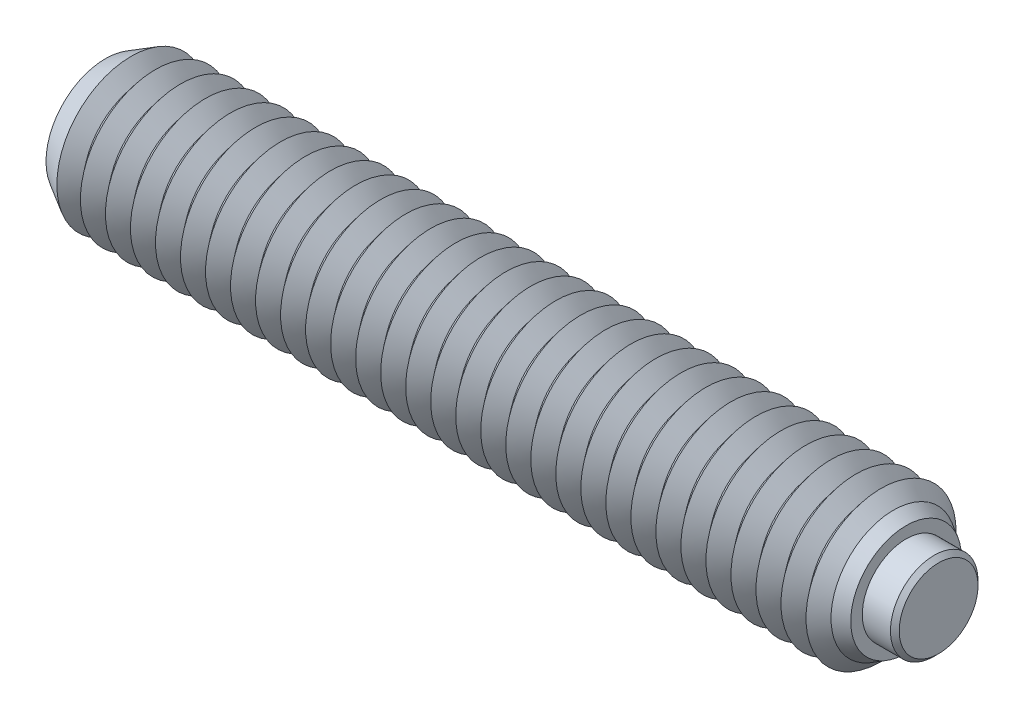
ISO-10303-21;
HEADER;
FILE_DESCRIPTION(('STEP AP214'),'2;1');
FILE_NAME('part.step','',(''),(''),'','','');
FILE_SCHEMA(('AUTOMOTIVE_DESIGN { 1 0 10303 214 1 1 1 1 }'));
ENDSEC;
DATA;
#1=APPLICATION_CONTEXT('core data for automotive mechanical design processes');
#2=APPLICATION_PROTOCOL_DEFINITION('international standard','automotive_design',2000,#1);
#3=PRODUCT_CONTEXT('',#1,'mechanical');
#4=PRODUCT('Part','Part','',(#3));
#5=PRODUCT_RELATED_PRODUCT_CATEGORY('part','',(#4));
#6=PRODUCT_DEFINITION_FORMATION('','',#4);
#7=PRODUCT_DEFINITION_CONTEXT('part definition',#1,'design');
#8=PRODUCT_DEFINITION('design','',#6,#7);
#9=PRODUCT_DEFINITION_SHAPE('','',#8);
#10=(LENGTH_UNIT() NAMED_UNIT(*) SI_UNIT(.MILLI.,.METRE.));
#11=(NAMED_UNIT(*) PLANE_ANGLE_UNIT() SI_UNIT($,.RADIAN.));
#12=(NAMED_UNIT(*) SI_UNIT($,.STERADIAN.) SOLID_ANGLE_UNIT());
#13=UNCERTAINTY_MEASURE_WITH_UNIT(LENGTH_MEASURE(1.E-05),#10,'distance_accuracy_value','');
#14=(GEOMETRIC_REPRESENTATION_CONTEXT(3) GLOBAL_UNCERTAINTY_ASSIGNED_CONTEXT((#13)) GLOBAL_UNIT_ASSIGNED_CONTEXT((#10,
#11,#12)) REPRESENTATION_CONTEXT('',''));
#15=CARTESIAN_POINT('',(0.,0.,0.));
#16=DIRECTION('',(0.,0.,1.));
#17=DIRECTION('',(1.,0.,0.));
#18=AXIS2_PLACEMENT_3D('',#15,#16,#17);
#19=CARTESIAN_POINT('',(1.8,0.,0.));
#20=DIRECTION('',(-1.,0.,0.));
#21=DIRECTION('',(0.,0.,1.));
#22=AXIS2_PLACEMENT_3D('',#19,#20,#21);
#23=CYLINDRICAL_SURFACE('',#22,1.75);
#24=CARTESIAN_POINT('',(1.625,0.,0.));
#25=DIRECTION('',(1.,0.,0.));
#26=DIRECTION('',(0.,0.,-1.));
#27=AXIS2_PLACEMENT_3D('',#24,#25,#26);
#28=CIRCLE('',#27,1.75);
#29=CARTESIAN_POINT('',(1.625,0.,-1.75));
#30=VERTEX_POINT('',#29);
#31=EDGE_CURVE('P0_E10',#30,#30,#28,.F.);
#32=ORIENTED_EDGE('',*,*,#31,.T.);
#33=EDGE_LOOP('',(#32));
#34=FACE_BOUND('',#33,.T.);
#35=CARTESIAN_POINT('',(-0.8,0.,0.));
#36=DIRECTION('',(1.,0.,0.));
#37=DIRECTION('',(0.,0.,-1.));
#38=AXIS2_PLACEMENT_3D('',#35,#36,#37);
#39=CIRCLE('',#38,1.75);
#40=CARTESIAN_POINT('',(-0.8,0.,-1.75));
#41=VERTEX_POINT('',#40);
#42=EDGE_CURVE('P0_E25',#41,#41,#39,.T.);
#43=ORIENTED_EDGE('',*,*,#42,.T.);
#44=EDGE_LOOP('',(#43));
#45=FACE_BOUND('',#44,.T.);
#46=ADVANCED_FACE('P0_F14',(#34,#45),#23,.T.);
#47=CARTESIAN_POINT('',(1.8,0.,0.));
#48=DIRECTION('',(1.,0.,0.));
#49=DIRECTION('',(0.,0.,-1.));
#50=AXIS2_PLACEMENT_3D('',#47,#48,#49);
#51=PLANE('',#50);
#52=CARTESIAN_POINT('',(1.8,0.,0.));
#53=DIRECTION('',(1.,0.,0.));
#54=DIRECTION('',(0.,0.,-1.));
#55=AXIS2_PLACEMENT_3D('',#52,#53,#54);
#56=CIRCLE('',#55,1.575);
#57=CARTESIAN_POINT('',(1.8,0.,-1.575));
#58=VERTEX_POINT('',#57);
#59=EDGE_CURVE('P0_E21',#58,#58,#56,.T.);
#60=ORIENTED_EDGE('',*,*,#59,.T.);
#61=EDGE_LOOP('',(#60));
#62=FACE_BOUND('',#61,.T.);
#63=ADVANCED_FACE('P0_F35',(#62),#51,.T.);
#64=CARTESIAN_POINT('',(-0.8,0.,0.));
#65=DIRECTION('',(1.,0.,0.));
#66=DIRECTION('',(0.,0.,-1.));
#67=AXIS2_PLACEMENT_3D('',#64,#65,#66);
#68=PLANE('',#67);
#69=ORIENTED_EDGE('',*,*,#42,.F.);
#70=EDGE_LOOP('',(#69));
#71=FACE_BOUND('',#70,.T.);
#72=ADVANCED_FACE('P0_F33',(#71),#68,.F.);
#73=CARTESIAN_POINT('',(1.8,0.,0.));
#74=DIRECTION('',(-1.,0.,0.));
#75=DIRECTION('',(0.,0.,1.));
#76=AXIS2_PLACEMENT_3D('',#73,#74,#75);
#77=CONICAL_SURFACE('',#76,1.575,0.785398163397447);
#78=ORIENTED_EDGE('',*,*,#31,.F.);
#79=EDGE_LOOP('',(#78));
#80=FACE_BOUND('',#79,.T.);
#81=ORIENTED_EDGE('',*,*,#59,.F.);
#82=EDGE_LOOP('',(#81));
#83=FACE_BOUND('',#82,.T.);
#84=ADVANCED_FACE('P0_F16',(#80,#83),#77,.T.);
#85=CLOSED_SHELL('',(#46,#63,#72,#84));
#86=MANIFOLD_SOLID_BREP('P0_B1',#85);
#87=CARTESIAN_POINT('',(-30.5,0.,0.));
#88=DIRECTION('',(-1.,0.,0.));
#89=DIRECTION('',(0.,0.,1.));
#90=AXIS2_PLACEMENT_3D('',#87,#88,#89);
#91=CONICAL_SURFACE('',#90,3.,0.895664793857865);
#92=CARTESIAN_POINT('',(-30.,0.,0.));
#93=DIRECTION('',(1.,0.,0.));
#94=DIRECTION('',(0.,0.,-1.));
#95=AXIS2_PLACEMENT_3D('',#92,#93,#94);
#96=CIRCLE('',#95,2.37550020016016);
#97=CARTESIAN_POINT('',(-30.,0.,-2.37550020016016));
#98=VERTEX_POINT('',#97);
#99=EDGE_CURVE('P1_E1269',#98,#98,#96,.T.);
#100=ORIENTED_EDGE('',*,*,#99,.F.);
#101=EDGE_LOOP('',(#100));
#102=FACE_BOUND('',#101,.T.);
#103=CARTESIAN_POINT('',(-30.4741837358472,0.,0.));
#104=DIRECTION('',(1.,0.,0.));
#105=DIRECTION('',(0.,0.,-1.));
#106=AXIS2_PLACEMENT_3D('',#103,#104,#105);
#107=CIRCLE('',#106,2.96775549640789);
#108=CARTESIAN_POINT('',(-30.4741837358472,0.,-2.96775549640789));
#109=VERTEX_POINT('',#108);
#110=EDGE_CURVE('P1_E1272',#109,#109,#107,.F.);
#111=ORIENTED_EDGE('',*,*,#110,.F.);
#112=EDGE_LOOP('',(#111));
#113=FACE_BOUND('',#112,.T.);
#114=ADVANCED_FACE('P1_F15',(#102,#113),#91,.T.);
#115=CARTESIAN_POINT('',(-1.,0.,0.));
#116=DIRECTION('',(1.,0.,0.));
#117=DIRECTION('',(0.,0.,-1.));
#118=AXIS2_PLACEMENT_3D('',#115,#116,#117);
#119=CONICAL_SURFACE('',#118,2.37550020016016,0.895664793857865);
#120=CARTESIAN_POINT('',(-0.5,0.,0.));
#121=DIRECTION('',(1.,0.,0.));
#122=DIRECTION('',(0.,0.,-1.));
#123=AXIS2_PLACEMENT_3D('',#120,#121,#122);
#124=CIRCLE('',#123,3.);
#125=CARTESIAN_POINT('',(-0.5,0.,-3.));
#126=VERTEX_POINT('',#125);
#127=EDGE_CURVE('P1_E1091',#126,#126,#124,.T.);
#128=ORIENTED_EDGE('',*,*,#127,.F.);
#129=EDGE_LOOP('',(#128));
#130=FACE_BOUND('',#129,.T.);
#131=CARTESIAN_POINT('',(-1.,0.,0.));
#132=DIRECTION('',(1.,0.,0.));
#133=DIRECTION('',(0.,0.,-1.));
#134=AXIS2_PLACEMENT_3D('',#131,#132,#133);
#135=CIRCLE('',#134,2.37550020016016);
#136=CARTESIAN_POINT('',(-1.,0.,-2.37550020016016));
#137=VERTEX_POINT('',#136);
#138=EDGE_CURVE('P1_E1092',#137,#137,#135,.T.);
#139=ORIENTED_EDGE('',*,*,#138,.T.);
#140=EDGE_LOOP('',(#139));
#141=FACE_BOUND('',#140,.T.);
#142=ADVANCED_FACE('P1_F222',(#130,#141),#119,.T.);
#143=CARTESIAN_POINT('',(-1.5,0.,0.));
#144=DIRECTION('',(-1.,0.,0.));
#145=DIRECTION('',(0.,0.,1.));
#146=AXIS2_PLACEMENT_3D('',#143,#144,#145);
#147=CONICAL_SURFACE('',#146,3.,0.895664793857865);
#148=ORIENTED_EDGE('',*,*,#138,.F.);
#149=EDGE_LOOP('',(#148));
#150=FACE_BOUND('',#149,.T.);
#151=CARTESIAN_POINT('',(-1.5,0.,0.));
#152=DIRECTION('',(1.,0.,0.));
#153=DIRECTION('',(0.,0.,-1.));
#154=AXIS2_PLACEMENT_3D('',#151,#152,#153);
#155=CIRCLE('',#154,3.);
#156=CARTESIAN_POINT('',(-1.5,0.,-3.));
#157=VERTEX_POINT('',#156);
#158=EDGE_CURVE('P1_E1096',#157,#157,#155,.T.);
#159=ORIENTED_EDGE('',*,*,#158,.T.);
#160=EDGE_LOOP('',(#159));
#161=FACE_BOUND('',#160,.T.);
#162=ADVANCED_FACE('P1_F227',(#150,#161),#147,.T.);
#163=CARTESIAN_POINT('',(-0.8,0.,0.));
#164=DIRECTION('',(1.,0.,0.));
#165=DIRECTION('',(0.,1.,0.));
#166=AXIS2_PLACEMENT_3D('',#163,#164,#165);
#167=PLANE('',#166);
#168=CARTESIAN_POINT('',(-0.8,0.,0.));
#169=DIRECTION('',(1.,0.,0.));
#170=DIRECTION('',(0.,1.,0.));
#171=AXIS2_PLACEMENT_3D('',#168,#169,#170);
#172=CIRCLE('',#171,1.75);
#173=CARTESIAN_POINT('',(-0.8,1.75,0.));
#174=VERTEX_POINT('',#173);
#175=EDGE_CURVE('P1_E534',#174,#174,#172,.T.);
#176=ORIENTED_EDGE('',*,*,#175,.T.);
#177=EDGE_LOOP('',(#176));
#178=FACE_BOUND('',#177,.T.);
#179=ADVANCED_FACE('P1_F461',(#178),#167,.T.);
#180=CARTESIAN_POINT('',(-0.8,0.,0.));
#181=DIRECTION('',(1.,0.,0.));
#182=DIRECTION('',(0.,1.,0.));
#183=AXIS2_PLACEMENT_3D('',#180,#181,#182);
#184=CYLINDRICAL_SURFACE('',#183,1.75);
#185=ORIENTED_EDGE('',*,*,#175,.F.);
#186=EDGE_LOOP('',(#185));
#187=FACE_BOUND('',#186,.T.);
#188=CARTESIAN_POINT('',(0.5,0.,0.));
#189=DIRECTION('',(1.,0.,0.));
#190=DIRECTION('',(0.,1.,0.));
#191=AXIS2_PLACEMENT_3D('',#188,#189,#190);
#192=CIRCLE('',#191,1.75);
#193=CARTESIAN_POINT('',(0.5,1.75,0.));
#194=VERTEX_POINT('',#193);
#195=EDGE_CURVE('P1_E537',#194,#194,#192,.T.);
#196=ORIENTED_EDGE('',*,*,#195,.T.);
#197=EDGE_LOOP('',(#196));
#198=FACE_BOUND('',#197,.T.);
#199=ADVANCED_FACE('P1_F209',(#187,#198),#184,.F.);
#200=CARTESIAN_POINT('',(0.5,2.21132486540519,0.));
#201=DIRECTION('',(1.,0.,0.));
#202=DIRECTION('',(0.,1.,0.));
#203=AXIS2_PLACEMENT_3D('',#200,#201,#202);
#204=PLANE('',#203);
#205=ORIENTED_EDGE('',*,*,#195,.F.);
#206=EDGE_LOOP('',(#205));
#207=FACE_BOUND('',#206,.T.);
#208=CARTESIAN_POINT('',(0.5,0.,0.));
#209=DIRECTION('',(1.,0.,0.));
#210=DIRECTION('',(0.,1.,0.));
#211=AXIS2_PLACEMENT_3D('',#208,#209,#210);
#212=CIRCLE('',#211,2.21132486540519);
#213=CARTESIAN_POINT('',(0.5,2.21132486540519,0.));
#214=VERTEX_POINT('',#213);
#215=EDGE_CURVE('P1_E121',#214,#214,#212,.T.);
#216=ORIENTED_EDGE('',*,*,#215,.T.);
#217=EDGE_LOOP('',(#216));
#218=FACE_BOUND('',#217,.T.);
#219=ADVANCED_FACE('P1_F206',(#207,#218),#204,.T.);
#220=CARTESIAN_POINT('',(0.5,0.,0.));
#221=DIRECTION('',(-1.,0.,0.));
#222=DIRECTION('',(0.,-1.,0.));
#223=AXIS2_PLACEMENT_3D('',#220,#221,#222);
#224=CONICAL_SURFACE('',#223,2.21132486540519,0.523598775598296);
#225=CARTESIAN_POINT('',(0.,0.,0.));
#226=DIRECTION('',(1.,0.,0.));
#227=DIRECTION('',(0.,0.,-1.));
#228=AXIS2_PLACEMENT_3D('',#225,#226,#227);
#229=CIRCLE('',#228,2.5);
#230=CARTESIAN_POINT('',(0.,0.,-2.5));
#231=VERTEX_POINT('',#230);
#232=EDGE_CURVE('P1_E525',#231,#231,#229,.T.);
#233=ORIENTED_EDGE('',*,*,#232,.T.);
#234=EDGE_LOOP('',(#233));
#235=FACE_BOUND('',#234,.T.);
#236=ORIENTED_EDGE('',*,*,#215,.F.);
#237=EDGE_LOOP('',(#236));
#238=FACE_BOUND('',#237,.T.);
#239=ADVANCED_FACE('P1_F203',(#235,#238),#224,.T.);
#240=CARTESIAN_POINT('',(0.,0.,0.));
#241=DIRECTION('',(-1.,0.,0.));
#242=DIRECTION('',(0.,0.,1.));
#243=AXIS2_PLACEMENT_3D('',#240,#241,#242);
#244=CONICAL_SURFACE('',#243,2.5,0.78539816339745);
#245=ORIENTED_EDGE('',*,*,#127,.T.);
#246=EDGE_LOOP('',(#245));
#247=FACE_BOUND('',#246,.T.);
#248=ORIENTED_EDGE('',*,*,#232,.F.);
#249=EDGE_LOOP('',(#248));
#250=FACE_BOUND('',#249,.T.);
#251=ADVANCED_FACE('P1_F17',(#247,#250),#244,.T.);
#252=CARTESIAN_POINT('',(-2.,0.,0.));
#253=DIRECTION('',(1.,0.,0.));
#254=DIRECTION('',(0.,0.,-1.));
#255=AXIS2_PLACEMENT_3D('',#252,#253,#254);
#256=CONICAL_SURFACE('',#255,2.37550020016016,0.895664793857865);
#257=ORIENTED_EDGE('',*,*,#158,.F.);
#258=EDGE_LOOP('',(#257));
#259=FACE_BOUND('',#258,.T.);
#260=CARTESIAN_POINT('',(-2.,0.,0.));
#261=DIRECTION('',(1.,0.,0.));
#262=DIRECTION('',(0.,0.,-1.));
#263=AXIS2_PLACEMENT_3D('',#260,#261,#262);
#264=CIRCLE('',#263,2.37550020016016);
#265=CARTESIAN_POINT('',(-2.,0.,-2.37550020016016));
#266=VERTEX_POINT('',#265);
#267=EDGE_CURVE('P1_E1101',#266,#266,#264,.T.);
#268=ORIENTED_EDGE('',*,*,#267,.T.);
#269=EDGE_LOOP('',(#268));
#270=FACE_BOUND('',#269,.T.);
#271=ADVANCED_FACE('P1_F455',(#259,#270),#256,.T.);
#272=CARTESIAN_POINT('',(-2.5,0.,0.));
#273=DIRECTION('',(-1.,0.,0.));
#274=DIRECTION('',(0.,0.,1.));
#275=AXIS2_PLACEMENT_3D('',#272,#273,#274);
#276=CONICAL_SURFACE('',#275,3.,0.895664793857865);
#277=ORIENTED_EDGE('',*,*,#267,.F.);
#278=EDGE_LOOP('',(#277));
#279=FACE_BOUND('',#278,.T.);
#280=CARTESIAN_POINT('',(-2.5,0.,0.));
#281=DIRECTION('',(1.,0.,0.));
#282=DIRECTION('',(0.,0.,-1.));
#283=AXIS2_PLACEMENT_3D('',#280,#281,#282);
#284=CIRCLE('',#283,3.);
#285=CARTESIAN_POINT('',(-2.5,0.,-3.));
#286=VERTEX_POINT('',#285);
#287=EDGE_CURVE('P1_E1104',#286,#286,#284,.T.);
#288=ORIENTED_EDGE('',*,*,#287,.T.);
#289=EDGE_LOOP('',(#288));
#290=FACE_BOUND('',#289,.T.);
#291=ADVANCED_FACE('P1_F451',(#279,#290),#276,.T.);
#292=CARTESIAN_POINT('',(-3.,0.,0.));
#293=DIRECTION('',(1.,0.,0.));
#294=DIRECTION('',(0.,0.,-1.));
#295=AXIS2_PLACEMENT_3D('',#292,#293,#294);
#296=CONICAL_SURFACE('',#295,2.37550020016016,0.895664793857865);
#297=ORIENTED_EDGE('',*,*,#287,.F.);
#298=EDGE_LOOP('',(#297));
#299=FACE_BOUND('',#298,.T.);
#300=CARTESIAN_POINT('',(-3.,0.,0.));
#301=DIRECTION('',(1.,0.,0.));
#302=DIRECTION('',(0.,0.,-1.));
#303=AXIS2_PLACEMENT_3D('',#300,#301,#302);
#304=CIRCLE('',#303,2.37550020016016);
#305=CARTESIAN_POINT('',(-3.,0.,-2.37550020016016));
#306=VERTEX_POINT('',#305);
#307=EDGE_CURVE('P1_E1107',#306,#306,#304,.T.);
#308=ORIENTED_EDGE('',*,*,#307,.T.);
#309=EDGE_LOOP('',(#308));
#310=FACE_BOUND('',#309,.T.);
#311=ADVANCED_FACE('P1_F447',(#299,#310),#296,.T.);
#312=CARTESIAN_POINT('',(-3.5,0.,0.));
#313=DIRECTION('',(-1.,0.,0.));
#314=DIRECTION('',(0.,0.,1.));
#315=AXIS2_PLACEMENT_3D('',#312,#313,#314);
#316=CONICAL_SURFACE('',#315,3.,0.895664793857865);
#317=ORIENTED_EDGE('',*,*,#307,.F.);
#318=EDGE_LOOP('',(#317));
#319=FACE_BOUND('',#318,.T.);
#320=CARTESIAN_POINT('',(-3.5,0.,0.));
#321=DIRECTION('',(1.,0.,0.));
#322=DIRECTION('',(0.,0.,-1.));
#323=AXIS2_PLACEMENT_3D('',#320,#321,#322);
#324=CIRCLE('',#323,3.);
#325=CARTESIAN_POINT('',(-3.5,0.,-3.));
#326=VERTEX_POINT('',#325);
#327=EDGE_CURVE('P1_E1110',#326,#326,#324,.T.);
#328=ORIENTED_EDGE('',*,*,#327,.T.);
#329=EDGE_LOOP('',(#328));
#330=FACE_BOUND('',#329,.T.);
#331=ADVANCED_FACE('P1_F443',(#319,#330),#316,.T.);
#332=CARTESIAN_POINT('',(-4.,0.,0.));
#333=DIRECTION('',(1.,0.,0.));
#334=DIRECTION('',(0.,0.,-1.));
#335=AXIS2_PLACEMENT_3D('',#332,#333,#334);
#336=CONICAL_SURFACE('',#335,2.37550020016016,0.895664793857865);
#337=ORIENTED_EDGE('',*,*,#327,.F.);
#338=EDGE_LOOP('',(#337));
#339=FACE_BOUND('',#338,.T.);
#340=CARTESIAN_POINT('',(-4.,0.,0.));
#341=DIRECTION('',(1.,0.,0.));
#342=DIRECTION('',(0.,0.,-1.));
#343=AXIS2_PLACEMENT_3D('',#340,#341,#342);
#344=CIRCLE('',#343,2.37550020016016);
#345=CARTESIAN_POINT('',(-4.,0.,-2.37550020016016));
#346=VERTEX_POINT('',#345);
#347=EDGE_CURVE('P1_E1113',#346,#346,#344,.T.);
#348=ORIENTED_EDGE('',*,*,#347,.T.);
#349=EDGE_LOOP('',(#348));
#350=FACE_BOUND('',#349,.T.);
#351=ADVANCED_FACE('P1_F439',(#339,#350),#336,.T.);
#352=CARTESIAN_POINT('',(-4.5,0.,0.));
#353=DIRECTION('',(-1.,0.,0.));
#354=DIRECTION('',(0.,0.,1.));
#355=AXIS2_PLACEMENT_3D('',#352,#353,#354);
#356=CONICAL_SURFACE('',#355,3.,0.895664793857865);
#357=ORIENTED_EDGE('',*,*,#347,.F.);
#358=EDGE_LOOP('',(#357));
#359=FACE_BOUND('',#358,.T.);
#360=CARTESIAN_POINT('',(-4.5,0.,0.));
#361=DIRECTION('',(1.,0.,0.));
#362=DIRECTION('',(0.,0.,-1.));
#363=AXIS2_PLACEMENT_3D('',#360,#361,#362);
#364=CIRCLE('',#363,3.);
#365=CARTESIAN_POINT('',(-4.5,0.,-3.));
#366=VERTEX_POINT('',#365);
#367=EDGE_CURVE('P1_E1116',#366,#366,#364,.T.);
#368=ORIENTED_EDGE('',*,*,#367,.T.);
#369=EDGE_LOOP('',(#368));
#370=FACE_BOUND('',#369,.T.);
#371=ADVANCED_FACE('P1_F435',(#359,#370),#356,.T.);
#372=CARTESIAN_POINT('',(-5.,0.,0.));
#373=DIRECTION('',(1.,0.,0.));
#374=DIRECTION('',(0.,0.,-1.));
#375=AXIS2_PLACEMENT_3D('',#372,#373,#374);
#376=CONICAL_SURFACE('',#375,2.37550020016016,0.895664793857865);
#377=ORIENTED_EDGE('',*,*,#367,.F.);
#378=EDGE_LOOP('',(#377));
#379=FACE_BOUND('',#378,.T.);
#380=CARTESIAN_POINT('',(-5.,0.,0.));
#381=DIRECTION('',(1.,0.,0.));
#382=DIRECTION('',(0.,0.,-1.));
#383=AXIS2_PLACEMENT_3D('',#380,#381,#382);
#384=CIRCLE('',#383,2.37550020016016);
#385=CARTESIAN_POINT('',(-5.,0.,-2.37550020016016));
#386=VERTEX_POINT('',#385);
#387=EDGE_CURVE('P1_E1119',#386,#386,#384,.T.);
#388=ORIENTED_EDGE('',*,*,#387,.T.);
#389=EDGE_LOOP('',(#388));
#390=FACE_BOUND('',#389,.T.);
#391=ADVANCED_FACE('P1_F431',(#379,#390),#376,.T.);
#392=CARTESIAN_POINT('',(-5.5,0.,0.));
#393=DIRECTION('',(-1.,0.,0.));
#394=DIRECTION('',(0.,0.,1.));
#395=AXIS2_PLACEMENT_3D('',#392,#393,#394);
#396=CONICAL_SURFACE('',#395,3.,0.895664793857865);
#397=ORIENTED_EDGE('',*,*,#387,.F.);
#398=EDGE_LOOP('',(#397));
#399=FACE_BOUND('',#398,.T.);
#400=CARTESIAN_POINT('',(-5.5,0.,0.));
#401=DIRECTION('',(1.,0.,0.));
#402=DIRECTION('',(0.,0.,-1.));
#403=AXIS2_PLACEMENT_3D('',#400,#401,#402);
#404=CIRCLE('',#403,3.);
#405=CARTESIAN_POINT('',(-5.5,0.,-3.));
#406=VERTEX_POINT('',#405);
#407=EDGE_CURVE('P1_E1122',#406,#406,#404,.T.);
#408=ORIENTED_EDGE('',*,*,#407,.T.);
#409=EDGE_LOOP('',(#408));
#410=FACE_BOUND('',#409,.T.);
#411=ADVANCED_FACE('P1_F427',(#399,#410),#396,.T.);
#412=CARTESIAN_POINT('',(-6.,0.,0.));
#413=DIRECTION('',(1.,0.,0.));
#414=DIRECTION('',(0.,0.,-1.));
#415=AXIS2_PLACEMENT_3D('',#412,#413,#414);
#416=CONICAL_SURFACE('',#415,2.37550020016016,0.895664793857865);
#417=ORIENTED_EDGE('',*,*,#407,.F.);
#418=EDGE_LOOP('',(#417));
#419=FACE_BOUND('',#418,.T.);
#420=CARTESIAN_POINT('',(-6.,0.,0.));
#421=DIRECTION('',(1.,0.,0.));
#422=DIRECTION('',(0.,0.,-1.));
#423=AXIS2_PLACEMENT_3D('',#420,#421,#422);
#424=CIRCLE('',#423,2.37550020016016);
#425=CARTESIAN_POINT('',(-6.,0.,-2.37550020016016));
#426=VERTEX_POINT('',#425);
#427=EDGE_CURVE('P1_E1125',#426,#426,#424,.T.);
#428=ORIENTED_EDGE('',*,*,#427,.T.);
#429=EDGE_LOOP('',(#428));
#430=FACE_BOUND('',#429,.T.);
#431=ADVANCED_FACE('P1_F423',(#419,#430),#416,.T.);
#432=CARTESIAN_POINT('',(-6.5,0.,0.));
#433=DIRECTION('',(-1.,0.,0.));
#434=DIRECTION('',(0.,0.,1.));
#435=AXIS2_PLACEMENT_3D('',#432,#433,#434);
#436=CONICAL_SURFACE('',#435,3.,0.895664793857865);
#437=ORIENTED_EDGE('',*,*,#427,.F.);
#438=EDGE_LOOP('',(#437));
#439=FACE_BOUND('',#438,.T.);
#440=CARTESIAN_POINT('',(-6.5,0.,0.));
#441=DIRECTION('',(1.,0.,0.));
#442=DIRECTION('',(0.,0.,-1.));
#443=AXIS2_PLACEMENT_3D('',#440,#441,#442);
#444=CIRCLE('',#443,3.);
#445=CARTESIAN_POINT('',(-6.5,0.,-3.));
#446=VERTEX_POINT('',#445);
#447=EDGE_CURVE('P1_E1128',#446,#446,#444,.T.);
#448=ORIENTED_EDGE('',*,*,#447,.T.);
#449=EDGE_LOOP('',(#448));
#450=FACE_BOUND('',#449,.T.);
#451=ADVANCED_FACE('P1_F419',(#439,#450),#436,.T.);
#452=CARTESIAN_POINT('',(-7.,0.,0.));
#453=DIRECTION('',(1.,0.,0.));
#454=DIRECTION('',(0.,0.,-1.));
#455=AXIS2_PLACEMENT_3D('',#452,#453,#454);
#456=CONICAL_SURFACE('',#455,2.37550020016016,0.895664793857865);
#457=ORIENTED_EDGE('',*,*,#447,.F.);
#458=EDGE_LOOP('',(#457));
#459=FACE_BOUND('',#458,.T.);
#460=CARTESIAN_POINT('',(-7.,0.,0.));
#461=DIRECTION('',(1.,0.,0.));
#462=DIRECTION('',(0.,0.,-1.));
#463=AXIS2_PLACEMENT_3D('',#460,#461,#462);
#464=CIRCLE('',#463,2.37550020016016);
#465=CARTESIAN_POINT('',(-7.,0.,-2.37550020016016));
#466=VERTEX_POINT('',#465);
#467=EDGE_CURVE('P1_E1131',#466,#466,#464,.T.);
#468=ORIENTED_EDGE('',*,*,#467,.T.);
#469=EDGE_LOOP('',(#468));
#470=FACE_BOUND('',#469,.T.);
#471=ADVANCED_FACE('P1_F415',(#459,#470),#456,.T.);
#472=CARTESIAN_POINT('',(-7.5,0.,0.));
#473=DIRECTION('',(-1.,0.,0.));
#474=DIRECTION('',(0.,0.,1.));
#475=AXIS2_PLACEMENT_3D('',#472,#473,#474);
#476=CONICAL_SURFACE('',#475,3.,0.895664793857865);
#477=ORIENTED_EDGE('',*,*,#467,.F.);
#478=EDGE_LOOP('',(#477));
#479=FACE_BOUND('',#478,.T.);
#480=CARTESIAN_POINT('',(-7.5,0.,0.));
#481=DIRECTION('',(1.,0.,0.));
#482=DIRECTION('',(0.,0.,-1.));
#483=AXIS2_PLACEMENT_3D('',#480,#481,#482);
#484=CIRCLE('',#483,3.);
#485=CARTESIAN_POINT('',(-7.5,0.,-3.));
#486=VERTEX_POINT('',#485);
#487=EDGE_CURVE('P1_E1134',#486,#486,#484,.T.);
#488=ORIENTED_EDGE('',*,*,#487,.T.);
#489=EDGE_LOOP('',(#488));
#490=FACE_BOUND('',#489,.T.);
#491=ADVANCED_FACE('P1_F411',(#479,#490),#476,.T.);
#492=CARTESIAN_POINT('',(-8.,0.,0.));
#493=DIRECTION('',(1.,0.,0.));
#494=DIRECTION('',(0.,0.,-1.));
#495=AXIS2_PLACEMENT_3D('',#492,#493,#494);
#496=CONICAL_SURFACE('',#495,2.37550020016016,0.895664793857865);
#497=ORIENTED_EDGE('',*,*,#487,.F.);
#498=EDGE_LOOP('',(#497));
#499=FACE_BOUND('',#498,.T.);
#500=CARTESIAN_POINT('',(-8.,0.,0.));
#501=DIRECTION('',(1.,0.,0.));
#502=DIRECTION('',(0.,0.,-1.));
#503=AXIS2_PLACEMENT_3D('',#500,#501,#502);
#504=CIRCLE('',#503,2.37550020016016);
#505=CARTESIAN_POINT('',(-8.,0.,-2.37550020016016));
#506=VERTEX_POINT('',#505);
#507=EDGE_CURVE('P1_E1137',#506,#506,#504,.T.);
#508=ORIENTED_EDGE('',*,*,#507,.T.);
#509=EDGE_LOOP('',(#508));
#510=FACE_BOUND('',#509,.T.);
#511=ADVANCED_FACE('P1_F407',(#499,#510),#496,.T.);
#512=CARTESIAN_POINT('',(-8.5,0.,0.));
#513=DIRECTION('',(-1.,0.,0.));
#514=DIRECTION('',(0.,0.,1.));
#515=AXIS2_PLACEMENT_3D('',#512,#513,#514);
#516=CONICAL_SURFACE('',#515,3.,0.895664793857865);
#517=ORIENTED_EDGE('',*,*,#507,.F.);
#518=EDGE_LOOP('',(#517));
#519=FACE_BOUND('',#518,.T.);
#520=CARTESIAN_POINT('',(-8.5,0.,0.));
#521=DIRECTION('',(1.,0.,0.));
#522=DIRECTION('',(0.,0.,-1.));
#523=AXIS2_PLACEMENT_3D('',#520,#521,#522);
#524=CIRCLE('',#523,3.);
#525=CARTESIAN_POINT('',(-8.5,0.,-3.));
#526=VERTEX_POINT('',#525);
#527=EDGE_CURVE('P1_E1140',#526,#526,#524,.T.);
#528=ORIENTED_EDGE('',*,*,#527,.T.);
#529=EDGE_LOOP('',(#528));
#530=FACE_BOUND('',#529,.T.);
#531=ADVANCED_FACE('P1_F403',(#519,#530),#516,.T.);
#532=CARTESIAN_POINT('',(-9.,0.,0.));
#533=DIRECTION('',(1.,0.,0.));
#534=DIRECTION('',(0.,0.,-1.));
#535=AXIS2_PLACEMENT_3D('',#532,#533,#534);
#536=CONICAL_SURFACE('',#535,2.37550020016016,0.895664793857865);
#537=ORIENTED_EDGE('',*,*,#527,.F.);
#538=EDGE_LOOP('',(#537));
#539=FACE_BOUND('',#538,.T.);
#540=CARTESIAN_POINT('',(-9.,0.,0.));
#541=DIRECTION('',(1.,0.,0.));
#542=DIRECTION('',(0.,0.,-1.));
#543=AXIS2_PLACEMENT_3D('',#540,#541,#542);
#544=CIRCLE('',#543,2.37550020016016);
#545=CARTESIAN_POINT('',(-9.,0.,-2.37550020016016));
#546=VERTEX_POINT('',#545);
#547=EDGE_CURVE('P1_E1143',#546,#546,#544,.T.);
#548=ORIENTED_EDGE('',*,*,#547,.T.);
#549=EDGE_LOOP('',(#548));
#550=FACE_BOUND('',#549,.T.);
#551=ADVANCED_FACE('P1_F399',(#539,#550),#536,.T.);
#552=CARTESIAN_POINT('',(-9.5,0.,0.));
#553=DIRECTION('',(-1.,0.,0.));
#554=DIRECTION('',(0.,0.,1.));
#555=AXIS2_PLACEMENT_3D('',#552,#553,#554);
#556=CONICAL_SURFACE('',#555,3.,0.895664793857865);
#557=ORIENTED_EDGE('',*,*,#547,.F.);
#558=EDGE_LOOP('',(#557));
#559=FACE_BOUND('',#558,.T.);
#560=CARTESIAN_POINT('',(-9.5,0.,0.));
#561=DIRECTION('',(1.,0.,0.));
#562=DIRECTION('',(0.,0.,-1.));
#563=AXIS2_PLACEMENT_3D('',#560,#561,#562);
#564=CIRCLE('',#563,3.);
#565=CARTESIAN_POINT('',(-9.5,0.,-3.));
#566=VERTEX_POINT('',#565);
#567=EDGE_CURVE('P1_E1146',#566,#566,#564,.T.);
#568=ORIENTED_EDGE('',*,*,#567,.T.);
#569=EDGE_LOOP('',(#568));
#570=FACE_BOUND('',#569,.T.);
#571=ADVANCED_FACE('P1_F395',(#559,#570),#556,.T.);
#572=CARTESIAN_POINT('',(-10.,0.,0.));
#573=DIRECTION('',(1.,0.,0.));
#574=DIRECTION('',(0.,0.,-1.));
#575=AXIS2_PLACEMENT_3D('',#572,#573,#574);
#576=CONICAL_SURFACE('',#575,2.37550020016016,0.895664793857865);
#577=ORIENTED_EDGE('',*,*,#567,.F.);
#578=EDGE_LOOP('',(#577));
#579=FACE_BOUND('',#578,.T.);
#580=CARTESIAN_POINT('',(-10.,0.,0.));
#581=DIRECTION('',(1.,0.,0.));
#582=DIRECTION('',(0.,0.,-1.));
#583=AXIS2_PLACEMENT_3D('',#580,#581,#582);
#584=CIRCLE('',#583,2.37550020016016);
#585=CARTESIAN_POINT('',(-10.,0.,-2.37550020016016));
#586=VERTEX_POINT('',#585);
#587=EDGE_CURVE('P1_E1149',#586,#586,#584,.T.);
#588=ORIENTED_EDGE('',*,*,#587,.T.);
#589=EDGE_LOOP('',(#588));
#590=FACE_BOUND('',#589,.T.);
#591=ADVANCED_FACE('P1_F391',(#579,#590),#576,.T.);
#592=CARTESIAN_POINT('',(-10.5,0.,0.));
#593=DIRECTION('',(-1.,0.,0.));
#594=DIRECTION('',(0.,0.,1.));
#595=AXIS2_PLACEMENT_3D('',#592,#593,#594);
#596=CONICAL_SURFACE('',#595,3.,0.895664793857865);
#597=ORIENTED_EDGE('',*,*,#587,.F.);
#598=EDGE_LOOP('',(#597));
#599=FACE_BOUND('',#598,.T.);
#600=CARTESIAN_POINT('',(-10.5,0.,0.));
#601=DIRECTION('',(1.,0.,0.));
#602=DIRECTION('',(0.,0.,-1.));
#603=AXIS2_PLACEMENT_3D('',#600,#601,#602);
#604=CIRCLE('',#603,3.);
#605=CARTESIAN_POINT('',(-10.5,0.,-3.));
#606=VERTEX_POINT('',#605);
#607=EDGE_CURVE('P1_E1152',#606,#606,#604,.T.);
#608=ORIENTED_EDGE('',*,*,#607,.T.);
#609=EDGE_LOOP('',(#608));
#610=FACE_BOUND('',#609,.T.);
#611=ADVANCED_FACE('P1_F387',(#599,#610),#596,.T.);
#612=CARTESIAN_POINT('',(-11.,0.,0.));
#613=DIRECTION('',(1.,0.,0.));
#614=DIRECTION('',(0.,0.,-1.));
#615=AXIS2_PLACEMENT_3D('',#612,#613,#614);
#616=CONICAL_SURFACE('',#615,2.37550020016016,0.895664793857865);
#617=ORIENTED_EDGE('',*,*,#607,.F.);
#618=EDGE_LOOP('',(#617));
#619=FACE_BOUND('',#618,.T.);
#620=CARTESIAN_POINT('',(-11.,0.,0.));
#621=DIRECTION('',(1.,0.,0.));
#622=DIRECTION('',(0.,0.,-1.));
#623=AXIS2_PLACEMENT_3D('',#620,#621,#622);
#624=CIRCLE('',#623,2.37550020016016);
#625=CARTESIAN_POINT('',(-11.,0.,-2.37550020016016));
#626=VERTEX_POINT('',#625);
#627=EDGE_CURVE('P1_E1155',#626,#626,#624,.T.);
#628=ORIENTED_EDGE('',*,*,#627,.T.);
#629=EDGE_LOOP('',(#628));
#630=FACE_BOUND('',#629,.T.);
#631=ADVANCED_FACE('P1_F383',(#619,#630),#616,.T.);
#632=CARTESIAN_POINT('',(-11.5,0.,0.));
#633=DIRECTION('',(-1.,0.,0.));
#634=DIRECTION('',(0.,0.,1.));
#635=AXIS2_PLACEMENT_3D('',#632,#633,#634);
#636=CONICAL_SURFACE('',#635,3.,0.895664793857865);
#637=ORIENTED_EDGE('',*,*,#627,.F.);
#638=EDGE_LOOP('',(#637));
#639=FACE_BOUND('',#638,.T.);
#640=CARTESIAN_POINT('',(-11.5,0.,0.));
#641=DIRECTION('',(1.,0.,0.));
#642=DIRECTION('',(0.,0.,-1.));
#643=AXIS2_PLACEMENT_3D('',#640,#641,#642);
#644=CIRCLE('',#643,3.);
#645=CARTESIAN_POINT('',(-11.5,0.,-3.));
#646=VERTEX_POINT('',#645);
#647=EDGE_CURVE('P1_E1158',#646,#646,#644,.T.);
#648=ORIENTED_EDGE('',*,*,#647,.T.);
#649=EDGE_LOOP('',(#648));
#650=FACE_BOUND('',#649,.T.);
#651=ADVANCED_FACE('P1_F379',(#639,#650),#636,.T.);
#652=CARTESIAN_POINT('',(-12.,0.,0.));
#653=DIRECTION('',(1.,0.,0.));
#654=DIRECTION('',(0.,0.,-1.));
#655=AXIS2_PLACEMENT_3D('',#652,#653,#654);
#656=CONICAL_SURFACE('',#655,2.37550020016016,0.895664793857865);
#657=ORIENTED_EDGE('',*,*,#647,.F.);
#658=EDGE_LOOP('',(#657));
#659=FACE_BOUND('',#658,.T.);
#660=CARTESIAN_POINT('',(-12.,0.,0.));
#661=DIRECTION('',(1.,0.,0.));
#662=DIRECTION('',(0.,0.,-1.));
#663=AXIS2_PLACEMENT_3D('',#660,#661,#662);
#664=CIRCLE('',#663,2.37550020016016);
#665=CARTESIAN_POINT('',(-12.,0.,-2.37550020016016));
#666=VERTEX_POINT('',#665);
#667=EDGE_CURVE('P1_E1161',#666,#666,#664,.T.);
#668=ORIENTED_EDGE('',*,*,#667,.T.);
#669=EDGE_LOOP('',(#668));
#670=FACE_BOUND('',#669,.T.);
#671=ADVANCED_FACE('P1_F375',(#659,#670),#656,.T.);
#672=CARTESIAN_POINT('',(-12.5,0.,0.));
#673=DIRECTION('',(-1.,0.,0.));
#674=DIRECTION('',(0.,0.,1.));
#675=AXIS2_PLACEMENT_3D('',#672,#673,#674);
#676=CONICAL_SURFACE('',#675,3.,0.895664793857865);
#677=ORIENTED_EDGE('',*,*,#667,.F.);
#678=EDGE_LOOP('',(#677));
#679=FACE_BOUND('',#678,.T.);
#680=CARTESIAN_POINT('',(-12.5,0.,0.));
#681=DIRECTION('',(1.,0.,0.));
#682=DIRECTION('',(0.,0.,-1.));
#683=AXIS2_PLACEMENT_3D('',#680,#681,#682);
#684=CIRCLE('',#683,3.);
#685=CARTESIAN_POINT('',(-12.5,0.,-3.));
#686=VERTEX_POINT('',#685);
#687=EDGE_CURVE('P1_E1164',#686,#686,#684,.T.);
#688=ORIENTED_EDGE('',*,*,#687,.T.);
#689=EDGE_LOOP('',(#688));
#690=FACE_BOUND('',#689,.T.);
#691=ADVANCED_FACE('P1_F371',(#679,#690),#676,.T.);
#692=CARTESIAN_POINT('',(-13.,0.,0.));
#693=DIRECTION('',(1.,0.,0.));
#694=DIRECTION('',(0.,0.,-1.));
#695=AXIS2_PLACEMENT_3D('',#692,#693,#694);
#696=CONICAL_SURFACE('',#695,2.37550020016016,0.895664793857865);
#697=ORIENTED_EDGE('',*,*,#687,.F.);
#698=EDGE_LOOP('',(#697));
#699=FACE_BOUND('',#698,.T.);
#700=CARTESIAN_POINT('',(-13.,0.,0.));
#701=DIRECTION('',(1.,0.,0.));
#702=DIRECTION('',(0.,0.,-1.));
#703=AXIS2_PLACEMENT_3D('',#700,#701,#702);
#704=CIRCLE('',#703,2.37550020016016);
#705=CARTESIAN_POINT('',(-13.,0.,-2.37550020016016));
#706=VERTEX_POINT('',#705);
#707=EDGE_CURVE('P1_E1167',#706,#706,#704,.T.);
#708=ORIENTED_EDGE('',*,*,#707,.T.);
#709=EDGE_LOOP('',(#708));
#710=FACE_BOUND('',#709,.T.);
#711=ADVANCED_FACE('P1_F367',(#699,#710),#696,.T.);
#712=CARTESIAN_POINT('',(-13.5,0.,0.));
#713=DIRECTION('',(-1.,0.,0.));
#714=DIRECTION('',(0.,0.,1.));
#715=AXIS2_PLACEMENT_3D('',#712,#713,#714);
#716=CONICAL_SURFACE('',#715,3.,0.895664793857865);
#717=ORIENTED_EDGE('',*,*,#707,.F.);
#718=EDGE_LOOP('',(#717));
#719=FACE_BOUND('',#718,.T.);
#720=CARTESIAN_POINT('',(-13.5,0.,0.));
#721=DIRECTION('',(1.,0.,0.));
#722=DIRECTION('',(0.,0.,-1.));
#723=AXIS2_PLACEMENT_3D('',#720,#721,#722);
#724=CIRCLE('',#723,3.);
#725=CARTESIAN_POINT('',(-13.5,0.,-3.));
#726=VERTEX_POINT('',#725);
#727=EDGE_CURVE('P1_E1170',#726,#726,#724,.T.);
#728=ORIENTED_EDGE('',*,*,#727,.T.);
#729=EDGE_LOOP('',(#728));
#730=FACE_BOUND('',#729,.T.);
#731=ADVANCED_FACE('P1_F363',(#719,#730),#716,.T.);
#732=CARTESIAN_POINT('',(-14.,0.,0.));
#733=DIRECTION('',(1.,0.,0.));
#734=DIRECTION('',(0.,0.,-1.));
#735=AXIS2_PLACEMENT_3D('',#732,#733,#734);
#736=CONICAL_SURFACE('',#735,2.37550020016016,0.895664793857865);
#737=ORIENTED_EDGE('',*,*,#727,.F.);
#738=EDGE_LOOP('',(#737));
#739=FACE_BOUND('',#738,.T.);
#740=CARTESIAN_POINT('',(-14.,0.,0.));
#741=DIRECTION('',(1.,0.,0.));
#742=DIRECTION('',(0.,0.,-1.));
#743=AXIS2_PLACEMENT_3D('',#740,#741,#742);
#744=CIRCLE('',#743,2.37550020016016);
#745=CARTESIAN_POINT('',(-14.,0.,-2.37550020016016));
#746=VERTEX_POINT('',#745);
#747=EDGE_CURVE('P1_E1173',#746,#746,#744,.T.);
#748=ORIENTED_EDGE('',*,*,#747,.T.);
#749=EDGE_LOOP('',(#748));
#750=FACE_BOUND('',#749,.T.);
#751=ADVANCED_FACE('P1_F359',(#739,#750),#736,.T.);
#752=CARTESIAN_POINT('',(-14.5,0.,0.));
#753=DIRECTION('',(-1.,0.,0.));
#754=DIRECTION('',(0.,0.,1.));
#755=AXIS2_PLACEMENT_3D('',#752,#753,#754);
#756=CONICAL_SURFACE('',#755,3.,0.895664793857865);
#757=ORIENTED_EDGE('',*,*,#747,.F.);
#758=EDGE_LOOP('',(#757));
#759=FACE_BOUND('',#758,.T.);
#760=CARTESIAN_POINT('',(-14.5,0.,0.));
#761=DIRECTION('',(1.,0.,0.));
#762=DIRECTION('',(0.,0.,-1.));
#763=AXIS2_PLACEMENT_3D('',#760,#761,#762);
#764=CIRCLE('',#763,3.);
#765=CARTESIAN_POINT('',(-14.5,0.,-3.));
#766=VERTEX_POINT('',#765);
#767=EDGE_CURVE('P1_E1176',#766,#766,#764,.T.);
#768=ORIENTED_EDGE('',*,*,#767,.T.);
#769=EDGE_LOOP('',(#768));
#770=FACE_BOUND('',#769,.T.);
#771=ADVANCED_FACE('P1_F355',(#759,#770),#756,.T.);
#772=CARTESIAN_POINT('',(-15.,0.,0.));
#773=DIRECTION('',(1.,0.,0.));
#774=DIRECTION('',(0.,0.,-1.));
#775=AXIS2_PLACEMENT_3D('',#772,#773,#774);
#776=CONICAL_SURFACE('',#775,2.37550020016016,0.895664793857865);
#777=ORIENTED_EDGE('',*,*,#767,.F.);
#778=EDGE_LOOP('',(#777));
#779=FACE_BOUND('',#778,.T.);
#780=CARTESIAN_POINT('',(-15.,0.,0.));
#781=DIRECTION('',(1.,0.,0.));
#782=DIRECTION('',(0.,0.,-1.));
#783=AXIS2_PLACEMENT_3D('',#780,#781,#782);
#784=CIRCLE('',#783,2.37550020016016);
#785=CARTESIAN_POINT('',(-15.,0.,-2.37550020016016));
#786=VERTEX_POINT('',#785);
#787=EDGE_CURVE('P1_E1179',#786,#786,#784,.T.);
#788=ORIENTED_EDGE('',*,*,#787,.T.);
#789=EDGE_LOOP('',(#788));
#790=FACE_BOUND('',#789,.T.);
#791=ADVANCED_FACE('P1_F351',(#779,#790),#776,.T.);
#792=CARTESIAN_POINT('',(-15.5,0.,0.));
#793=DIRECTION('',(-1.,0.,0.));
#794=DIRECTION('',(0.,0.,1.));
#795=AXIS2_PLACEMENT_3D('',#792,#793,#794);
#796=CONICAL_SURFACE('',#795,3.,0.895664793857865);
#797=ORIENTED_EDGE('',*,*,#787,.F.);
#798=EDGE_LOOP('',(#797));
#799=FACE_BOUND('',#798,.T.);
#800=CARTESIAN_POINT('',(-15.5,0.,0.));
#801=DIRECTION('',(1.,0.,0.));
#802=DIRECTION('',(0.,0.,-1.));
#803=AXIS2_PLACEMENT_3D('',#800,#801,#802);
#804=CIRCLE('',#803,3.);
#805=CARTESIAN_POINT('',(-15.5,0.,-3.));
#806=VERTEX_POINT('',#805);
#807=EDGE_CURVE('P1_E1182',#806,#806,#804,.T.);
#808=ORIENTED_EDGE('',*,*,#807,.T.);
#809=EDGE_LOOP('',(#808));
#810=FACE_BOUND('',#809,.T.);
#811=ADVANCED_FACE('P1_F347',(#799,#810),#796,.T.);
#812=CARTESIAN_POINT('',(-16.,0.,0.));
#813=DIRECTION('',(1.,0.,0.));
#814=DIRECTION('',(0.,0.,-1.));
#815=AXIS2_PLACEMENT_3D('',#812,#813,#814);
#816=CONICAL_SURFACE('',#815,2.37550020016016,0.895664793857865);
#817=ORIENTED_EDGE('',*,*,#807,.F.);
#818=EDGE_LOOP('',(#817));
#819=FACE_BOUND('',#818,.T.);
#820=CARTESIAN_POINT('',(-16.,0.,0.));
#821=DIRECTION('',(1.,0.,0.));
#822=DIRECTION('',(0.,0.,-1.));
#823=AXIS2_PLACEMENT_3D('',#820,#821,#822);
#824=CIRCLE('',#823,2.37550020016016);
#825=CARTESIAN_POINT('',(-16.,0.,-2.37550020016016));
#826=VERTEX_POINT('',#825);
#827=EDGE_CURVE('P1_E1185',#826,#826,#824,.T.);
#828=ORIENTED_EDGE('',*,*,#827,.T.);
#829=EDGE_LOOP('',(#828));
#830=FACE_BOUND('',#829,.T.);
#831=ADVANCED_FACE('P1_F343',(#819,#830),#816,.T.);
#832=CARTESIAN_POINT('',(-16.5,0.,0.));
#833=DIRECTION('',(-1.,0.,0.));
#834=DIRECTION('',(0.,0.,1.));
#835=AXIS2_PLACEMENT_3D('',#832,#833,#834);
#836=CONICAL_SURFACE('',#835,3.,0.895664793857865);
#837=ORIENTED_EDGE('',*,*,#827,.F.);
#838=EDGE_LOOP('',(#837));
#839=FACE_BOUND('',#838,.T.);
#840=CARTESIAN_POINT('',(-16.5,0.,0.));
#841=DIRECTION('',(1.,0.,0.));
#842=DIRECTION('',(0.,0.,-1.));
#843=AXIS2_PLACEMENT_3D('',#840,#841,#842);
#844=CIRCLE('',#843,3.);
#845=CARTESIAN_POINT('',(-16.5,0.,-3.));
#846=VERTEX_POINT('',#845);
#847=EDGE_CURVE('P1_E1188',#846,#846,#844,.T.);
#848=ORIENTED_EDGE('',*,*,#847,.T.);
#849=EDGE_LOOP('',(#848));
#850=FACE_BOUND('',#849,.T.);
#851=ADVANCED_FACE('P1_F339',(#839,#850),#836,.T.);
#852=CARTESIAN_POINT('',(-17.,0.,0.));
#853=DIRECTION('',(1.,0.,0.));
#854=DIRECTION('',(0.,0.,-1.));
#855=AXIS2_PLACEMENT_3D('',#852,#853,#854);
#856=CONICAL_SURFACE('',#855,2.37550020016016,0.895664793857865);
#857=ORIENTED_EDGE('',*,*,#847,.F.);
#858=EDGE_LOOP('',(#857));
#859=FACE_BOUND('',#858,.T.);
#860=CARTESIAN_POINT('',(-17.,0.,0.));
#861=DIRECTION('',(1.,0.,0.));
#862=DIRECTION('',(0.,0.,-1.));
#863=AXIS2_PLACEMENT_3D('',#860,#861,#862);
#864=CIRCLE('',#863,2.37550020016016);
#865=CARTESIAN_POINT('',(-17.,0.,-2.37550020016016));
#866=VERTEX_POINT('',#865);
#867=EDGE_CURVE('P1_E1191',#866,#866,#864,.T.);
#868=ORIENTED_EDGE('',*,*,#867,.T.);
#869=EDGE_LOOP('',(#868));
#870=FACE_BOUND('',#869,.T.);
#871=ADVANCED_FACE('P1_F335',(#859,#870),#856,.T.);
#872=CARTESIAN_POINT('',(-17.5,0.,0.));
#873=DIRECTION('',(-1.,0.,0.));
#874=DIRECTION('',(0.,0.,1.));
#875=AXIS2_PLACEMENT_3D('',#872,#873,#874);
#876=CONICAL_SURFACE('',#875,3.,0.895664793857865);
#877=ORIENTED_EDGE('',*,*,#867,.F.);
#878=EDGE_LOOP('',(#877));
#879=FACE_BOUND('',#878,.T.);
#880=CARTESIAN_POINT('',(-17.5,0.,0.));
#881=DIRECTION('',(1.,0.,0.));
#882=DIRECTION('',(0.,0.,-1.));
#883=AXIS2_PLACEMENT_3D('',#880,#881,#882);
#884=CIRCLE('',#883,3.);
#885=CARTESIAN_POINT('',(-17.5,0.,-3.));
#886=VERTEX_POINT('',#885);
#887=EDGE_CURVE('P1_E1194',#886,#886,#884,.T.);
#888=ORIENTED_EDGE('',*,*,#887,.T.);
#889=EDGE_LOOP('',(#888));
#890=FACE_BOUND('',#889,.T.);
#891=ADVANCED_FACE('P1_F331',(#879,#890),#876,.T.);
#892=CARTESIAN_POINT('',(-18.,0.,0.));
#893=DIRECTION('',(1.,0.,0.));
#894=DIRECTION('',(0.,0.,-1.));
#895=AXIS2_PLACEMENT_3D('',#892,#893,#894);
#896=CONICAL_SURFACE('',#895,2.37550020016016,0.895664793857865);
#897=ORIENTED_EDGE('',*,*,#887,.F.);
#898=EDGE_LOOP('',(#897));
#899=FACE_BOUND('',#898,.T.);
#900=CARTESIAN_POINT('',(-18.,0.,0.));
#901=DIRECTION('',(1.,0.,0.));
#902=DIRECTION('',(0.,0.,-1.));
#903=AXIS2_PLACEMENT_3D('',#900,#901,#902);
#904=CIRCLE('',#903,2.37550020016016);
#905=CARTESIAN_POINT('',(-18.,0.,-2.37550020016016));
#906=VERTEX_POINT('',#905);
#907=EDGE_CURVE('P1_E1197',#906,#906,#904,.T.);
#908=ORIENTED_EDGE('',*,*,#907,.T.);
#909=EDGE_LOOP('',(#908));
#910=FACE_BOUND('',#909,.T.);
#911=ADVANCED_FACE('P1_F327',(#899,#910),#896,.T.);
#912=CARTESIAN_POINT('',(-18.5,0.,0.));
#913=DIRECTION('',(-1.,0.,0.));
#914=DIRECTION('',(0.,0.,1.));
#915=AXIS2_PLACEMENT_3D('',#912,#913,#914);
#916=CONICAL_SURFACE('',#915,3.,0.895664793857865);
#917=ORIENTED_EDGE('',*,*,#907,.F.);
#918=EDGE_LOOP('',(#917));
#919=FACE_BOUND('',#918,.T.);
#920=CARTESIAN_POINT('',(-18.5,0.,0.));
#921=DIRECTION('',(1.,0.,0.));
#922=DIRECTION('',(0.,0.,-1.));
#923=AXIS2_PLACEMENT_3D('',#920,#921,#922);
#924=CIRCLE('',#923,3.);
#925=CARTESIAN_POINT('',(-18.5,0.,-3.));
#926=VERTEX_POINT('',#925);
#927=EDGE_CURVE('P1_E1200',#926,#926,#924,.T.);
#928=ORIENTED_EDGE('',*,*,#927,.T.);
#929=EDGE_LOOP('',(#928));
#930=FACE_BOUND('',#929,.T.);
#931=ADVANCED_FACE('P1_F323',(#919,#930),#916,.T.);
#932=CARTESIAN_POINT('',(-19.,0.,0.));
#933=DIRECTION('',(1.,0.,0.));
#934=DIRECTION('',(0.,0.,-1.));
#935=AXIS2_PLACEMENT_3D('',#932,#933,#934);
#936=CONICAL_SURFACE('',#935,2.37550020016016,0.895664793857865);
#937=ORIENTED_EDGE('',*,*,#927,.F.);
#938=EDGE_LOOP('',(#937));
#939=FACE_BOUND('',#938,.T.);
#940=CARTESIAN_POINT('',(-19.,0.,0.));
#941=DIRECTION('',(1.,0.,0.));
#942=DIRECTION('',(0.,0.,-1.));
#943=AXIS2_PLACEMENT_3D('',#940,#941,#942);
#944=CIRCLE('',#943,2.37550020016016);
#945=CARTESIAN_POINT('',(-19.,0.,-2.37550020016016));
#946=VERTEX_POINT('',#945);
#947=EDGE_CURVE('P1_E1203',#946,#946,#944,.T.);
#948=ORIENTED_EDGE('',*,*,#947,.T.);
#949=EDGE_LOOP('',(#948));
#950=FACE_BOUND('',#949,.T.);
#951=ADVANCED_FACE('P1_F319',(#939,#950),#936,.T.);
#952=CARTESIAN_POINT('',(-19.5,0.,0.));
#953=DIRECTION('',(-1.,0.,0.));
#954=DIRECTION('',(0.,0.,1.));
#955=AXIS2_PLACEMENT_3D('',#952,#953,#954);
#956=CONICAL_SURFACE('',#955,3.,0.895664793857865);
#957=ORIENTED_EDGE('',*,*,#947,.F.);
#958=EDGE_LOOP('',(#957));
#959=FACE_BOUND('',#958,.T.);
#960=CARTESIAN_POINT('',(-19.5,0.,0.));
#961=DIRECTION('',(1.,0.,0.));
#962=DIRECTION('',(0.,0.,-1.));
#963=AXIS2_PLACEMENT_3D('',#960,#961,#962);
#964=CIRCLE('',#963,3.);
#965=CARTESIAN_POINT('',(-19.5,0.,-3.));
#966=VERTEX_POINT('',#965);
#967=EDGE_CURVE('P1_E1206',#966,#966,#964,.T.);
#968=ORIENTED_EDGE('',*,*,#967,.T.);
#969=EDGE_LOOP('',(#968));
#970=FACE_BOUND('',#969,.T.);
#971=ADVANCED_FACE('P1_F315',(#959,#970),#956,.T.);
#972=CARTESIAN_POINT('',(-20.,0.,0.));
#973=DIRECTION('',(1.,0.,0.));
#974=DIRECTION('',(0.,0.,-1.));
#975=AXIS2_PLACEMENT_3D('',#972,#973,#974);
#976=CONICAL_SURFACE('',#975,2.37550020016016,0.895664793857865);
#977=ORIENTED_EDGE('',*,*,#967,.F.);
#978=EDGE_LOOP('',(#977));
#979=FACE_BOUND('',#978,.T.);
#980=CARTESIAN_POINT('',(-20.,0.,0.));
#981=DIRECTION('',(1.,0.,0.));
#982=DIRECTION('',(0.,0.,-1.));
#983=AXIS2_PLACEMENT_3D('',#980,#981,#982);
#984=CIRCLE('',#983,2.37550020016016);
#985=CARTESIAN_POINT('',(-20.,0.,-2.37550020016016));
#986=VERTEX_POINT('',#985);
#987=EDGE_CURVE('P1_E1209',#986,#986,#984,.T.);
#988=ORIENTED_EDGE('',*,*,#987,.T.);
#989=EDGE_LOOP('',(#988));
#990=FACE_BOUND('',#989,.T.);
#991=ADVANCED_FACE('P1_F311',(#979,#990),#976,.T.);
#992=CARTESIAN_POINT('',(-20.5,0.,0.));
#993=DIRECTION('',(-1.,0.,0.));
#994=DIRECTION('',(0.,0.,1.));
#995=AXIS2_PLACEMENT_3D('',#992,#993,#994);
#996=CONICAL_SURFACE('',#995,3.,0.895664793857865);
#997=ORIENTED_EDGE('',*,*,#987,.F.);
#998=EDGE_LOOP('',(#997));
#999=FACE_BOUND('',#998,.T.);
#1000=CARTESIAN_POINT('',(-20.5,0.,0.));
#1001=DIRECTION('',(1.,0.,0.));
#1002=DIRECTION('',(0.,0.,-1.));
#1003=AXIS2_PLACEMENT_3D('',#1000,#1001,#1002);
#1004=CIRCLE('',#1003,3.);
#1005=CARTESIAN_POINT('',(-20.5,0.,-3.));
#1006=VERTEX_POINT('',#1005);
#1007=EDGE_CURVE('P1_E1212',#1006,#1006,#1004,.T.);
#1008=ORIENTED_EDGE('',*,*,#1007,.T.);
#1009=EDGE_LOOP('',(#1008));
#1010=FACE_BOUND('',#1009,.T.);
#1011=ADVANCED_FACE('P1_F307',(#999,#1010),#996,.T.);
#1012=CARTESIAN_POINT('',(-21.,0.,0.));
#1013=DIRECTION('',(1.,0.,0.));
#1014=DIRECTION('',(0.,0.,-1.));
#1015=AXIS2_PLACEMENT_3D('',#1012,#1013,#1014);
#1016=CONICAL_SURFACE('',#1015,2.37550020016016,0.895664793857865);
#1017=ORIENTED_EDGE('',*,*,#1007,.F.);
#1018=EDGE_LOOP('',(#1017));
#1019=FACE_BOUND('',#1018,.T.);
#1020=CARTESIAN_POINT('',(-21.,0.,0.));
#1021=DIRECTION('',(1.,0.,0.));
#1022=DIRECTION('',(0.,0.,-1.));
#1023=AXIS2_PLACEMENT_3D('',#1020,#1021,#1022);
#1024=CIRCLE('',#1023,2.37550020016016);
#1025=CARTESIAN_POINT('',(-21.,0.,-2.37550020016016));
#1026=VERTEX_POINT('',#1025);
#1027=EDGE_CURVE('P1_E1215',#1026,#1026,#1024,.T.);
#1028=ORIENTED_EDGE('',*,*,#1027,.T.);
#1029=EDGE_LOOP('',(#1028));
#1030=FACE_BOUND('',#1029,.T.);
#1031=ADVANCED_FACE('P1_F303',(#1019,#1030),#1016,.T.);
#1032=CARTESIAN_POINT('',(-21.5,0.,0.));
#1033=DIRECTION('',(-1.,0.,0.));
#1034=DIRECTION('',(0.,0.,1.));
#1035=AXIS2_PLACEMENT_3D('',#1032,#1033,#1034);
#1036=CONICAL_SURFACE('',#1035,3.,0.895664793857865);
#1037=ORIENTED_EDGE('',*,*,#1027,.F.);
#1038=EDGE_LOOP('',(#1037));
#1039=FACE_BOUND('',#1038,.T.);
#1040=CARTESIAN_POINT('',(-21.5,0.,0.));
#1041=DIRECTION('',(1.,0.,0.));
#1042=DIRECTION('',(0.,0.,-1.));
#1043=AXIS2_PLACEMENT_3D('',#1040,#1041,#1042);
#1044=CIRCLE('',#1043,3.);
#1045=CARTESIAN_POINT('',(-21.5,0.,-3.));
#1046=VERTEX_POINT('',#1045);
#1047=EDGE_CURVE('P1_E1218',#1046,#1046,#1044,.T.);
#1048=ORIENTED_EDGE('',*,*,#1047,.T.);
#1049=EDGE_LOOP('',(#1048));
#1050=FACE_BOUND('',#1049,.T.);
#1051=ADVANCED_FACE('P1_F299',(#1039,#1050),#1036,.T.);
#1052=CARTESIAN_POINT('',(-22.,0.,0.));
#1053=DIRECTION('',(1.,0.,0.));
#1054=DIRECTION('',(0.,0.,-1.));
#1055=AXIS2_PLACEMENT_3D('',#1052,#1053,#1054);
#1056=CONICAL_SURFACE('',#1055,2.37550020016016,0.895664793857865);
#1057=ORIENTED_EDGE('',*,*,#1047,.F.);
#1058=EDGE_LOOP('',(#1057));
#1059=FACE_BOUND('',#1058,.T.);
#1060=CARTESIAN_POINT('',(-22.,0.,0.));
#1061=DIRECTION('',(1.,0.,0.));
#1062=DIRECTION('',(0.,0.,-1.));
#1063=AXIS2_PLACEMENT_3D('',#1060,#1061,#1062);
#1064=CIRCLE('',#1063,2.37550020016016);
#1065=CARTESIAN_POINT('',(-22.,0.,-2.37550020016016));
#1066=VERTEX_POINT('',#1065);
#1067=EDGE_CURVE('P1_E1221',#1066,#1066,#1064,.T.);
#1068=ORIENTED_EDGE('',*,*,#1067,.T.);
#1069=EDGE_LOOP('',(#1068));
#1070=FACE_BOUND('',#1069,.T.);
#1071=ADVANCED_FACE('P1_F295',(#1059,#1070),#1056,.T.);
#1072=CARTESIAN_POINT('',(-22.5,0.,0.));
#1073=DIRECTION('',(-1.,0.,0.));
#1074=DIRECTION('',(0.,0.,1.));
#1075=AXIS2_PLACEMENT_3D('',#1072,#1073,#1074);
#1076=CONICAL_SURFACE('',#1075,3.,0.895664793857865);
#1077=ORIENTED_EDGE('',*,*,#1067,.F.);
#1078=EDGE_LOOP('',(#1077));
#1079=FACE_BOUND('',#1078,.T.);
#1080=CARTESIAN_POINT('',(-22.5,0.,0.));
#1081=DIRECTION('',(1.,0.,0.));
#1082=DIRECTION('',(0.,0.,-1.));
#1083=AXIS2_PLACEMENT_3D('',#1080,#1081,#1082);
#1084=CIRCLE('',#1083,3.);
#1085=CARTESIAN_POINT('',(-22.5,0.,-3.));
#1086=VERTEX_POINT('',#1085);
#1087=EDGE_CURVE('P1_E1224',#1086,#1086,#1084,.T.);
#1088=ORIENTED_EDGE('',*,*,#1087,.T.);
#1089=EDGE_LOOP('',(#1088));
#1090=FACE_BOUND('',#1089,.T.);
#1091=ADVANCED_FACE('P1_F291',(#1079,#1090),#1076,.T.);
#1092=CARTESIAN_POINT('',(-23.,0.,0.));
#1093=DIRECTION('',(1.,0.,0.));
#1094=DIRECTION('',(0.,0.,-1.));
#1095=AXIS2_PLACEMENT_3D('',#1092,#1093,#1094);
#1096=CONICAL_SURFACE('',#1095,2.37550020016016,0.895664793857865);
#1097=ORIENTED_EDGE('',*,*,#1087,.F.);
#1098=EDGE_LOOP('',(#1097));
#1099=FACE_BOUND('',#1098,.T.);
#1100=CARTESIAN_POINT('',(-23.,0.,0.));
#1101=DIRECTION('',(1.,0.,0.));
#1102=DIRECTION('',(0.,0.,-1.));
#1103=AXIS2_PLACEMENT_3D('',#1100,#1101,#1102);
#1104=CIRCLE('',#1103,2.37550020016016);
#1105=CARTESIAN_POINT('',(-23.,0.,-2.37550020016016));
#1106=VERTEX_POINT('',#1105);
#1107=EDGE_CURVE('P1_E1227',#1106,#1106,#1104,.T.);
#1108=ORIENTED_EDGE('',*,*,#1107,.T.);
#1109=EDGE_LOOP('',(#1108));
#1110=FACE_BOUND('',#1109,.T.);
#1111=ADVANCED_FACE('P1_F287',(#1099,#1110),#1096,.T.);
#1112=CARTESIAN_POINT('',(-23.5,0.,0.));
#1113=DIRECTION('',(-1.,0.,0.));
#1114=DIRECTION('',(0.,0.,1.));
#1115=AXIS2_PLACEMENT_3D('',#1112,#1113,#1114);
#1116=CONICAL_SURFACE('',#1115,3.,0.895664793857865);
#1117=ORIENTED_EDGE('',*,*,#1107,.F.);
#1118=EDGE_LOOP('',(#1117));
#1119=FACE_BOUND('',#1118,.T.);
#1120=CARTESIAN_POINT('',(-23.5,0.,0.));
#1121=DIRECTION('',(1.,0.,0.));
#1122=DIRECTION('',(0.,0.,-1.));
#1123=AXIS2_PLACEMENT_3D('',#1120,#1121,#1122);
#1124=CIRCLE('',#1123,3.);
#1125=CARTESIAN_POINT('',(-23.5,0.,-3.));
#1126=VERTEX_POINT('',#1125);
#1127=EDGE_CURVE('P1_E1230',#1126,#1126,#1124,.T.);
#1128=ORIENTED_EDGE('',*,*,#1127,.T.);
#1129=EDGE_LOOP('',(#1128));
#1130=FACE_BOUND('',#1129,.T.);
#1131=ADVANCED_FACE('P1_F283',(#1119,#1130),#1116,.T.);
#1132=CARTESIAN_POINT('',(-24.,0.,0.));
#1133=DIRECTION('',(1.,0.,0.));
#1134=DIRECTION('',(0.,0.,-1.));
#1135=AXIS2_PLACEMENT_3D('',#1132,#1133,#1134);
#1136=CONICAL_SURFACE('',#1135,2.37550020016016,0.895664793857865);
#1137=ORIENTED_EDGE('',*,*,#1127,.F.);
#1138=EDGE_LOOP('',(#1137));
#1139=FACE_BOUND('',#1138,.T.);
#1140=CARTESIAN_POINT('',(-24.,0.,0.));
#1141=DIRECTION('',(1.,0.,0.));
#1142=DIRECTION('',(0.,0.,-1.));
#1143=AXIS2_PLACEMENT_3D('',#1140,#1141,#1142);
#1144=CIRCLE('',#1143,2.37550020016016);
#1145=CARTESIAN_POINT('',(-24.,0.,-2.37550020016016));
#1146=VERTEX_POINT('',#1145);
#1147=EDGE_CURVE('P1_E1233',#1146,#1146,#1144,.T.);
#1148=ORIENTED_EDGE('',*,*,#1147,.T.);
#1149=EDGE_LOOP('',(#1148));
#1150=FACE_BOUND('',#1149,.T.);
#1151=ADVANCED_FACE('P1_F279',(#1139,#1150),#1136,.T.);
#1152=CARTESIAN_POINT('',(-24.5,0.,0.));
#1153=DIRECTION('',(-1.,0.,0.));
#1154=DIRECTION('',(0.,0.,1.));
#1155=AXIS2_PLACEMENT_3D('',#1152,#1153,#1154);
#1156=CONICAL_SURFACE('',#1155,3.,0.895664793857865);
#1157=ORIENTED_EDGE('',*,*,#1147,.F.);
#1158=EDGE_LOOP('',(#1157));
#1159=FACE_BOUND('',#1158,.T.);
#1160=CARTESIAN_POINT('',(-24.5,0.,0.));
#1161=DIRECTION('',(1.,0.,0.));
#1162=DIRECTION('',(0.,0.,-1.));
#1163=AXIS2_PLACEMENT_3D('',#1160,#1161,#1162);
#1164=CIRCLE('',#1163,3.);
#1165=CARTESIAN_POINT('',(-24.5,0.,-3.));
#1166=VERTEX_POINT('',#1165);
#1167=EDGE_CURVE('P1_E1236',#1166,#1166,#1164,.T.);
#1168=ORIENTED_EDGE('',*,*,#1167,.T.);
#1169=EDGE_LOOP('',(#1168));
#1170=FACE_BOUND('',#1169,.T.);
#1171=ADVANCED_FACE('P1_F275',(#1159,#1170),#1156,.T.);
#1172=CARTESIAN_POINT('',(-25.,0.,0.));
#1173=DIRECTION('',(1.,0.,0.));
#1174=DIRECTION('',(0.,0.,-1.));
#1175=AXIS2_PLACEMENT_3D('',#1172,#1173,#1174);
#1176=CONICAL_SURFACE('',#1175,2.37550020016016,0.895664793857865);
#1177=ORIENTED_EDGE('',*,*,#1167,.F.);
#1178=EDGE_LOOP('',(#1177));
#1179=FACE_BOUND('',#1178,.T.);
#1180=CARTESIAN_POINT('',(-25.,0.,0.));
#1181=DIRECTION('',(1.,0.,0.));
#1182=DIRECTION('',(0.,0.,-1.));
#1183=AXIS2_PLACEMENT_3D('',#1180,#1181,#1182);
#1184=CIRCLE('',#1183,2.37550020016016);
#1185=CARTESIAN_POINT('',(-25.,0.,-2.37550020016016));
#1186=VERTEX_POINT('',#1185);
#1187=EDGE_CURVE('P1_E1239',#1186,#1186,#1184,.T.);
#1188=ORIENTED_EDGE('',*,*,#1187,.T.);
#1189=EDGE_LOOP('',(#1188));
#1190=FACE_BOUND('',#1189,.T.);
#1191=ADVANCED_FACE('P1_F271',(#1179,#1190),#1176,.T.);
#1192=CARTESIAN_POINT('',(-25.5,0.,0.));
#1193=DIRECTION('',(-1.,0.,0.));
#1194=DIRECTION('',(0.,0.,1.));
#1195=AXIS2_PLACEMENT_3D('',#1192,#1193,#1194);
#1196=CONICAL_SURFACE('',#1195,3.,0.895664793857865);
#1197=ORIENTED_EDGE('',*,*,#1187,.F.);
#1198=EDGE_LOOP('',(#1197));
#1199=FACE_BOUND('',#1198,.T.);
#1200=CARTESIAN_POINT('',(-25.5,0.,0.));
#1201=DIRECTION('',(1.,0.,0.));
#1202=DIRECTION('',(0.,0.,-1.));
#1203=AXIS2_PLACEMENT_3D('',#1200,#1201,#1202);
#1204=CIRCLE('',#1203,3.);
#1205=CARTESIAN_POINT('',(-25.5,0.,-3.));
#1206=VERTEX_POINT('',#1205);
#1207=EDGE_CURVE('P1_E1242',#1206,#1206,#1204,.T.);
#1208=ORIENTED_EDGE('',*,*,#1207,.T.);
#1209=EDGE_LOOP('',(#1208));
#1210=FACE_BOUND('',#1209,.T.);
#1211=ADVANCED_FACE('P1_F267',(#1199,#1210),#1196,.T.);
#1212=CARTESIAN_POINT('',(-26.,0.,0.));
#1213=DIRECTION('',(1.,0.,0.));
#1214=DIRECTION('',(0.,0.,-1.));
#1215=AXIS2_PLACEMENT_3D('',#1212,#1213,#1214);
#1216=CONICAL_SURFACE('',#1215,2.37550020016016,0.895664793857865);
#1217=ORIENTED_EDGE('',*,*,#1207,.F.);
#1218=EDGE_LOOP('',(#1217));
#1219=FACE_BOUND('',#1218,.T.);
#1220=CARTESIAN_POINT('',(-26.,0.,0.));
#1221=DIRECTION('',(1.,0.,0.));
#1222=DIRECTION('',(0.,0.,-1.));
#1223=AXIS2_PLACEMENT_3D('',#1220,#1221,#1222);
#1224=CIRCLE('',#1223,2.37550020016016);
#1225=CARTESIAN_POINT('',(-26.,0.,-2.37550020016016));
#1226=VERTEX_POINT('',#1225);
#1227=EDGE_CURVE('P1_E1245',#1226,#1226,#1224,.T.);
#1228=ORIENTED_EDGE('',*,*,#1227,.T.);
#1229=EDGE_LOOP('',(#1228));
#1230=FACE_BOUND('',#1229,.T.);
#1231=ADVANCED_FACE('P1_F263',(#1219,#1230),#1216,.T.);
#1232=CARTESIAN_POINT('',(-26.5,0.,0.));
#1233=DIRECTION('',(-1.,0.,0.));
#1234=DIRECTION('',(0.,0.,1.));
#1235=AXIS2_PLACEMENT_3D('',#1232,#1233,#1234);
#1236=CONICAL_SURFACE('',#1235,3.,0.895664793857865);
#1237=ORIENTED_EDGE('',*,*,#1227,.F.);
#1238=EDGE_LOOP('',(#1237));
#1239=FACE_BOUND('',#1238,.T.);
#1240=CARTESIAN_POINT('',(-26.5,0.,0.));
#1241=DIRECTION('',(1.,0.,0.));
#1242=DIRECTION('',(0.,0.,-1.));
#1243=AXIS2_PLACEMENT_3D('',#1240,#1241,#1242);
#1244=CIRCLE('',#1243,3.);
#1245=CARTESIAN_POINT('',(-26.5,0.,-3.));
#1246=VERTEX_POINT('',#1245);
#1247=EDGE_CURVE('P1_E1248',#1246,#1246,#1244,.T.);
#1248=ORIENTED_EDGE('',*,*,#1247,.T.);
#1249=EDGE_LOOP('',(#1248));
#1250=FACE_BOUND('',#1249,.T.);
#1251=ADVANCED_FACE('P1_F259',(#1239,#1250),#1236,.T.);
#1252=CARTESIAN_POINT('',(-27.,0.,0.));
#1253=DIRECTION('',(1.,0.,0.));
#1254=DIRECTION('',(0.,0.,-1.));
#1255=AXIS2_PLACEMENT_3D('',#1252,#1253,#1254);
#1256=CONICAL_SURFACE('',#1255,2.37550020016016,0.895664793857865);
#1257=ORIENTED_EDGE('',*,*,#1247,.F.);
#1258=EDGE_LOOP('',(#1257));
#1259=FACE_BOUND('',#1258,.T.);
#1260=CARTESIAN_POINT('',(-27.,0.,0.));
#1261=DIRECTION('',(1.,0.,0.));
#1262=DIRECTION('',(0.,0.,-1.));
#1263=AXIS2_PLACEMENT_3D('',#1260,#1261,#1262);
#1264=CIRCLE('',#1263,2.37550020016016);
#1265=CARTESIAN_POINT('',(-27.,0.,-2.37550020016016));
#1266=VERTEX_POINT('',#1265);
#1267=EDGE_CURVE('P1_E1251',#1266,#1266,#1264,.T.);
#1268=ORIENTED_EDGE('',*,*,#1267,.T.);
#1269=EDGE_LOOP('',(#1268));
#1270=FACE_BOUND('',#1269,.T.);
#1271=ADVANCED_FACE('P1_F255',(#1259,#1270),#1256,.T.);
#1272=CARTESIAN_POINT('',(-27.5,0.,0.));
#1273=DIRECTION('',(-1.,0.,0.));
#1274=DIRECTION('',(0.,0.,1.));
#1275=AXIS2_PLACEMENT_3D('',#1272,#1273,#1274);
#1276=CONICAL_SURFACE('',#1275,3.,0.895664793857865);
#1277=ORIENTED_EDGE('',*,*,#1267,.F.);
#1278=EDGE_LOOP('',(#1277));
#1279=FACE_BOUND('',#1278,.T.);
#1280=CARTESIAN_POINT('',(-27.5,0.,0.));
#1281=DIRECTION('',(1.,0.,0.));
#1282=DIRECTION('',(0.,0.,-1.));
#1283=AXIS2_PLACEMENT_3D('',#1280,#1281,#1282);
#1284=CIRCLE('',#1283,3.);
#1285=CARTESIAN_POINT('',(-27.5,0.,-3.));
#1286=VERTEX_POINT('',#1285);
#1287=EDGE_CURVE('P1_E1254',#1286,#1286,#1284,.T.);
#1288=ORIENTED_EDGE('',*,*,#1287,.T.);
#1289=EDGE_LOOP('',(#1288));
#1290=FACE_BOUND('',#1289,.T.);
#1291=ADVANCED_FACE('P1_F251',(#1279,#1290),#1276,.T.);
#1292=CARTESIAN_POINT('',(-28.,0.,0.));
#1293=DIRECTION('',(1.,0.,0.));
#1294=DIRECTION('',(0.,0.,-1.));
#1295=AXIS2_PLACEMENT_3D('',#1292,#1293,#1294);
#1296=CONICAL_SURFACE('',#1295,2.37550020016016,0.895664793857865);
#1297=ORIENTED_EDGE('',*,*,#1287,.F.);
#1298=EDGE_LOOP('',(#1297));
#1299=FACE_BOUND('',#1298,.T.);
#1300=CARTESIAN_POINT('',(-28.,0.,0.));
#1301=DIRECTION('',(1.,0.,0.));
#1302=DIRECTION('',(0.,0.,-1.));
#1303=AXIS2_PLACEMENT_3D('',#1300,#1301,#1302);
#1304=CIRCLE('',#1303,2.37550020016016);
#1305=CARTESIAN_POINT('',(-28.,0.,-2.37550020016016));
#1306=VERTEX_POINT('',#1305);
#1307=EDGE_CURVE('P1_E1257',#1306,#1306,#1304,.T.);
#1308=ORIENTED_EDGE('',*,*,#1307,.T.);
#1309=EDGE_LOOP('',(#1308));
#1310=FACE_BOUND('',#1309,.T.);
#1311=ADVANCED_FACE('P1_F247',(#1299,#1310),#1296,.T.);
#1312=CARTESIAN_POINT('',(-28.5,0.,0.));
#1313=DIRECTION('',(-1.,0.,0.));
#1314=DIRECTION('',(0.,0.,1.));
#1315=AXIS2_PLACEMENT_3D('',#1312,#1313,#1314);
#1316=CONICAL_SURFACE('',#1315,3.,0.895664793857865);
#1317=ORIENTED_EDGE('',*,*,#1307,.F.);
#1318=EDGE_LOOP('',(#1317));
#1319=FACE_BOUND('',#1318,.T.);
#1320=CARTESIAN_POINT('',(-28.5,0.,0.));
#1321=DIRECTION('',(1.,0.,0.));
#1322=DIRECTION('',(0.,0.,-1.));
#1323=AXIS2_PLACEMENT_3D('',#1320,#1321,#1322);
#1324=CIRCLE('',#1323,3.);
#1325=CARTESIAN_POINT('',(-28.5,0.,-3.));
#1326=VERTEX_POINT('',#1325);
#1327=EDGE_CURVE('P1_E1260',#1326,#1326,#1324,.T.);
#1328=ORIENTED_EDGE('',*,*,#1327,.T.);
#1329=EDGE_LOOP('',(#1328));
#1330=FACE_BOUND('',#1329,.T.);
#1331=ADVANCED_FACE('P1_F243',(#1319,#1330),#1316,.T.);
#1332=CARTESIAN_POINT('',(-29.,0.,0.));
#1333=DIRECTION('',(1.,0.,0.));
#1334=DIRECTION('',(0.,0.,-1.));
#1335=AXIS2_PLACEMENT_3D('',#1332,#1333,#1334);
#1336=CONICAL_SURFACE('',#1335,2.37550020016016,0.895664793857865);
#1337=ORIENTED_EDGE('',*,*,#1327,.F.);
#1338=EDGE_LOOP('',(#1337));
#1339=FACE_BOUND('',#1338,.T.);
#1340=CARTESIAN_POINT('',(-29.,0.,0.));
#1341=DIRECTION('',(1.,0.,0.));
#1342=DIRECTION('',(0.,0.,-1.));
#1343=AXIS2_PLACEMENT_3D('',#1340,#1341,#1342);
#1344=CIRCLE('',#1343,2.37550020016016);
#1345=CARTESIAN_POINT('',(-29.,0.,-2.37550020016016));
#1346=VERTEX_POINT('',#1345);
#1347=EDGE_CURVE('P1_E1263',#1346,#1346,#1344,.T.);
#1348=ORIENTED_EDGE('',*,*,#1347,.T.);
#1349=EDGE_LOOP('',(#1348));
#1350=FACE_BOUND('',#1349,.T.);
#1351=ADVANCED_FACE('P1_F239',(#1339,#1350),#1336,.T.);
#1352=CARTESIAN_POINT('',(-29.5,0.,0.));
#1353=DIRECTION('',(-1.,0.,0.));
#1354=DIRECTION('',(0.,0.,1.));
#1355=AXIS2_PLACEMENT_3D('',#1352,#1353,#1354);
#1356=CONICAL_SURFACE('',#1355,3.,0.895664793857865);
#1357=ORIENTED_EDGE('',*,*,#1347,.F.);
#1358=EDGE_LOOP('',(#1357));
#1359=FACE_BOUND('',#1358,.T.);
#1360=CARTESIAN_POINT('',(-29.5,0.,0.));
#1361=DIRECTION('',(1.,0.,0.));
#1362=DIRECTION('',(0.,0.,-1.));
#1363=AXIS2_PLACEMENT_3D('',#1360,#1361,#1362);
#1364=CIRCLE('',#1363,3.);
#1365=CARTESIAN_POINT('',(-29.5,0.,-3.));
#1366=VERTEX_POINT('',#1365);
#1367=EDGE_CURVE('P1_E1266',#1366,#1366,#1364,.T.);
#1368=ORIENTED_EDGE('',*,*,#1367,.T.);
#1369=EDGE_LOOP('',(#1368));
#1370=FACE_BOUND('',#1369,.T.);
#1371=ADVANCED_FACE('P1_F235',(#1359,#1370),#1356,.T.);
#1372=CARTESIAN_POINT('',(-30.,0.,0.));
#1373=DIRECTION('',(1.,0.,0.));
#1374=DIRECTION('',(0.,0.,-1.));
#1375=AXIS2_PLACEMENT_3D('',#1372,#1373,#1374);
#1376=CONICAL_SURFACE('',#1375,2.37550020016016,0.895664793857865);
#1377=ORIENTED_EDGE('',*,*,#1367,.F.);
#1378=EDGE_LOOP('',(#1377));
#1379=FACE_BOUND('',#1378,.T.);
#1380=ORIENTED_EDGE('',*,*,#99,.T.);
#1381=EDGE_LOOP('',(#1380));
#1382=FACE_BOUND('',#1381,.T.);
#1383=ADVANCED_FACE('P1_F219',(#1379,#1382),#1376,.T.);
#1384=CARTESIAN_POINT('',(-31.5,0.,0.));
#1385=DIRECTION('',(1.,0.,0.));
#1386=DIRECTION('',(0.,0.,1.));
#1387=AXIS2_PLACEMENT_3D('',#1384,#1385,#1386);
#1388=CONICAL_SURFACE('',#1387,2.37550020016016,0.5235987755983);
#1389=CARTESIAN_POINT('',(-31.5,0.,0.));
#1390=DIRECTION('',(-1.,0.,0.));
#1391=DIRECTION('',(0.,0.,1.));
#1392=AXIS2_PLACEMENT_3D('',#1389,#1390,#1391);
#1393=CIRCLE('',#1392,2.37550020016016);
#1394=CARTESIAN_POINT('',(-31.5,0.,2.37550020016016));
#1395=VERTEX_POINT('',#1394);
#1396=EDGE_CURVE('P1_E1274',#1395,#1395,#1393,.T.);
#1397=ORIENTED_EDGE('',*,*,#1396,.F.);
#1398=EDGE_LOOP('',(#1397));
#1399=FACE_BOUND('',#1398,.T.);
#1400=ORIENTED_EDGE('',*,*,#110,.T.);
#1401=EDGE_LOOP('',(#1400));
#1402=FACE_BOUND('',#1401,.T.);
#1403=ADVANCED_FACE('P1_F159',(#1399,#1402),#1388,.T.);
#1404=CARTESIAN_POINT('',(-31.5,0.,0.));
#1405=DIRECTION('',(1.,0.,0.));
#1406=DIRECTION('',(0.,0.,-1.));
#1407=AXIS2_PLACEMENT_3D('',#1404,#1405,#1406);
#1408=PLANE('',#1407);
#1409=CARTESIAN_POINT('',(-31.5,0.,0.));
#1410=DIRECTION('',(1.,0.,0.));
#1411=DIRECTION('',(0.,0.,-1.));
#1412=AXIS2_PLACEMENT_3D('',#1409,#1410,#1411);
#1413=CIRCLE('',#1412,1.73205080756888);
#1414=CARTESIAN_POINT('',(-31.5,-1.5,-0.866025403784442));
#1415=VERTEX_POINT('',#1414);
#1416=CARTESIAN_POINT('',(-31.5,0.,-1.73205080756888));
#1417=VERTEX_POINT('',#1416);
#1418=EDGE_CURVE('P1_E19',#1415,#1417,#1413,.T.);
#1419=ORIENTED_EDGE('',*,*,#1418,.T.);
#1420=CARTESIAN_POINT('',(-31.5,1.5,-0.866025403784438));
#1421=VERTEX_POINT('',#1420);
#1422=EDGE_CURVE('P1_E10',#1417,#1421,#1413,.T.);
#1423=ORIENTED_EDGE('',*,*,#1422,.T.);
#1424=CARTESIAN_POINT('',(-31.5,1.5,0.866025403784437));
#1425=VERTEX_POINT('',#1424);
#1426=EDGE_CURVE('P1_E24',#1421,#1425,#1413,.T.);
#1427=ORIENTED_EDGE('',*,*,#1426,.T.);
#1428=CARTESIAN_POINT('',(-31.5,0.,0.));
#1429=DIRECTION('',(-1.,0.,0.));
#1430=DIRECTION('',(0.,0.,1.));
#1431=AXIS2_PLACEMENT_3D('',#1428,#1429,#1430);
#1432=CIRCLE('',#1431,1.73205080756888);
#1433=CARTESIAN_POINT('',(-31.5,0.,1.73205080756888));
#1434=VERTEX_POINT('',#1433);
#1435=EDGE_CURVE('P1_E92',#1434,#1425,#1432,.T.);
#1436=ORIENTED_EDGE('',*,*,#1435,.F.);
#1437=CARTESIAN_POINT('',(-31.5,-1.5,0.86602540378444));
#1438=VERTEX_POINT('',#1437);
#1439=EDGE_CURVE('P1_E101',#1434,#1438,#1413,.T.);
#1440=ORIENTED_EDGE('',*,*,#1439,.T.);
#1441=EDGE_CURVE('P1_E107',#1438,#1415,#1413,.T.);
#1442=ORIENTED_EDGE('',*,*,#1441,.T.);
#1443=EDGE_LOOP('',(#1419,#1423,#1427,#1436,#1440,#1442));
#1444=FACE_BOUND('',#1443,.T.);
#1445=ORIENTED_EDGE('',*,*,#1396,.T.);
#1446=EDGE_LOOP('',(#1445));
#1447=FACE_BOUND('',#1446,.T.);
#1448=ADVANCED_FACE('P1_F108',(#1444,#1447),#1408,.F.);
#1449=CARTESIAN_POINT('',(-31.5,0.,0.));
#1450=DIRECTION('',(-1.,0.,0.));
#1451=DIRECTION('',(0.,0.,1.));
#1452=AXIS2_PLACEMENT_3D('',#1449,#1450,#1451);
#1453=CONICAL_SURFACE('',#1452,1.73205080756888,1.0471975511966);
#1454=ORIENTED_EDGE('',*,*,#1418,.F.);
#1455=CARTESIAN_POINT('',(-31.5000666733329,0.000200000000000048,-1.73216627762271));
#1456=CARTESIAN_POINT('',(-31.4780828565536,-0.0657192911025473,-1.69410775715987));
#1457=CARTESIAN_POINT('',(-31.4580888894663,-0.132207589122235,-1.65572072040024));
#1458=CARTESIAN_POINT('',(-31.4231881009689,-0.266335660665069,-1.5782818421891));
#1459=CARTESIAN_POINT('',(-31.4082936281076,-0.333977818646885,-1.53922862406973));
#1460=CARTESIAN_POINT('',(-31.3851066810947,-0.468423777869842,-1.4616062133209));
#1461=CARTESIAN_POINT('',(-31.3766599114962,-0.535206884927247,-1.42304896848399));
#1462=CARTESIAN_POINT('',(-31.3665735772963,-0.66908756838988,-1.34575291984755));
#1463=CARTESIAN_POINT('',(-31.3649256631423,-0.736184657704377,-1.30701439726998));
#1464=CARTESIAN_POINT('',(-31.3683416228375,-0.861574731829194,-1.23462040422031));
#1465=CARTESIAN_POINT('',(-31.3725667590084,-0.919886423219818,-1.20095413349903));
#1466=CARTESIAN_POINT('',(-31.3859617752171,-1.03612987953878,-1.13384094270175));
#1467=CARTESIAN_POINT('',(-31.3951362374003,-1.09406124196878,-1.10039425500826));
#1468=CARTESIAN_POINT('',(-31.4180731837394,-1.21054465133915,-1.03314252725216));
#1469=CARTESIAN_POINT('',(-31.4319329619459,-1.26908194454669,-0.999346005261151));
#1470=CARTESIAN_POINT('',(-31.4633897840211,-1.38528312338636,-0.932257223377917));
#1471=CARTESIAN_POINT('',(-31.480979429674,-1.44294849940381,-0.89896410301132));
#1472=CARTESIAN_POINT('',(-31.5000666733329,-1.5002,-0.865909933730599));
#1473=B_SPLINE_CURVE_WITH_KNOTS('',3,(#1455,#1456,#1457,#1458,#1459,#1460,#1461,#1462,#1463,
#1464,#1465,#1466,#1467,#1468,#1469,#1470,#1471,#1472),.UNSPECIFIED.,.F.,.F.,(4,2,2,2,2,2,2,2,
4),(0.,0.237777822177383,0.476127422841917,0.708577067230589,0.94074115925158,1.1429435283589,
1.34533342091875,1.55221450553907,1.75868901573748),.UNSPECIFIED.);
#1474=EDGE_CURVE('P1_E130',#1417,#1415,#1473,.T.);
#1475=ORIENTED_EDGE('',*,*,#1474,.F.);
#1476=EDGE_LOOP('',(#1454,#1475));
#1477=FACE_BOUND('',#1476,.T.);
#1478=ADVANCED_FACE('P1_F158',(#1477),#1453,.F.);
#1479=ORIENTED_EDGE('',*,*,#1441,.F.);
#1480=CARTESIAN_POINT('',(-32.0577529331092,-1.5,-2.2427176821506));
#1481=CARTESIAN_POINT('',(-32.0266762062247,-1.5,-2.17794242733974));
#1482=CARTESIAN_POINT('',(-31.995922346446,-1.5,-2.11300950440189));
#1483=CARTESIAN_POINT('',(-31.9352433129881,-1.5,-1.98274395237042));
#1484=CARTESIAN_POINT('',(-31.9053182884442,-1.5,-1.91741125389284));
#1485=CARTESIAN_POINT('',(-31.846312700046,-1.5,-1.78588718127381));
#1486=CARTESIAN_POINT('',(-31.8172383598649,-1.5,-1.71969300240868));
#1487=CARTESIAN_POINT('',(-31.7603940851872,-1.5,-1.58675026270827));
#1488=CARTESIAN_POINT('',(-31.7326240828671,-1.5,-1.52000173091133));
#1489=CARTESIAN_POINT('',(-31.6780255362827,-1.5,-1.38408099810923));
#1490=CARTESIAN_POINT('',(-31.6512405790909,-1.5,-1.3148910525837));
#1491=CARTESIAN_POINT('',(-31.5999065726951,-1.5,-1.17568930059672));
#1492=CARTESIAN_POINT('',(-31.5753578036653,-1.5,-1.10567739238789));
#1493=CARTESIAN_POINT('',(-31.5061010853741,-1.5,-0.894522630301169));
#1494=CARTESIAN_POINT('',(-31.4656202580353,-1.5,-0.751874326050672));
#1495=CARTESIAN_POINT('',(-31.4186644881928,-1.5,-0.535047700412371));
#1496=CARTESIAN_POINT('',(-31.4053128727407,-1.5,-0.462365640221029));
#1497=CARTESIAN_POINT('',(-31.3841134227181,-1.5,-0.316183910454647));
#1498=CARTESIAN_POINT('',(-31.3762652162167,-1.5,-0.242684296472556));
#1499=CARTESIAN_POINT('',(-31.3667985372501,-1.5,-0.0961589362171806));
#1500=CARTESIAN_POINT('',(-31.3651065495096,-1.5,-0.0231380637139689));
#1501=CARTESIAN_POINT('',(-31.3678994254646,-1.5,0.122783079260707));
#1502=CARTESIAN_POINT('',(-31.3723846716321,-1.5,0.19568334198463));
#1503=CARTESIAN_POINT('',(-31.3906776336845,-1.5,0.375553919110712));
#1504=CARTESIAN_POINT('',(-31.4079134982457,-1.5,0.482175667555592));
#1505=CARTESIAN_POINT('',(-31.4523598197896,-1.5,0.693345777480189));
#1506=CARTESIAN_POINT('',(-31.4795822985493,-1.5,0.797891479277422));
#1507=CARTESIAN_POINT('',(-31.5260849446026,-1.5,0.954251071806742));
#1508=CARTESIAN_POINT('',(-31.5427475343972,-1.5,1.00687320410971));
#1509=CARTESIAN_POINT('',(-31.5776140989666,-1.5,1.11156970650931));
#1510=CARTESIAN_POINT('',(-31.595817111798,-1.5,1.16364439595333));
#1511=CARTESIAN_POINT('',(-31.6335001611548,-1.5,1.26731560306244));
#1512=CARTESIAN_POINT('',(-31.6529799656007,-1.5,1.31891220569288));
#1513=CARTESIAN_POINT('',(-31.6930058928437,-1.5,1.42169884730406));
#1514=CARTESIAN_POINT('',(-31.7135521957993,-1.5,1.47288881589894));
#1515=CARTESIAN_POINT('',(-31.7673136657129,-1.5,1.60355339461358));
#1516=CARTESIAN_POINT('',(-31.8011631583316,-1.5,1.68276673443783));
#1517=CARTESIAN_POINT('',(-31.8704938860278,-1.5,1.84047808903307));
#1518=CARTESIAN_POINT('',(-31.905975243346,-1.5,1.91897604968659));
#1519=CARTESIAN_POINT('',(-32.0142918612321,-1.5,2.15363522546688));
#1520=CARTESIAN_POINT('',(-32.0889885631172,-1.5,2.30893552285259));
#1521=CARTESIAN_POINT('',(-32.2415147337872,-1.5,2.61820933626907));
#1522=CARTESIAN_POINT('',(-32.3193479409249,-1.5,2.77218098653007));
#1523=CARTESIAN_POINT('',(-32.4770156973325,-1.5,3.07906936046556));
#1524=CARTESIAN_POINT('',(-32.5568499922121,-1.5,3.23198621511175));
#1525=CARTESIAN_POINT('',(-32.7102968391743,-1.5,3.52269097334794));
#1526=CARTESIAN_POINT('',(-32.7837854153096,-1.5,3.66054454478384));
#1527=CARTESIAN_POINT('',(-32.9315998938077,-1.5,3.9358082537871));
#1528=CARTESIAN_POINT('',(-33.0059258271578,-1.5,4.07321837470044));
#1529=CARTESIAN_POINT('',(-33.1550151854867,-1.5,4.34734790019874));
#1530=CARTESIAN_POINT('',(-33.2297770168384,-1.5,4.48406817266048));
#1531=CARTESIAN_POINT('',(-33.3797872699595,-1.5,4.75723230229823));
#1532=CARTESIAN_POINT('',(-33.4550356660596,-1.5,4.89367617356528));
#1533=CARTESIAN_POINT('',(-33.53046248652,-1.5,5.03002074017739));
#1534=B_SPLINE_CURVE_WITH_KNOTS('',3,(#1480,#1481,#1482,#1483,#1484,#1485,#1486,#1487,#1488,
#1489,#1490,#1491,#1492,#1493,#1494,#1495,#1496,#1497,#1498,#1499,#1500,#1501,#1502,#1503,#1504,
#1505,#1506,#1507,#1508,#1509,#1510,#1511,#1512,#1513,#1514,#1515,#1516,#1517,#1518,#1519,#1520,
#1521,#1522,#1523,#1524,#1525,#1526,#1527,#1528,#1529,#1530,#1531,#1532,#1533),.UNSPECIFIED.,
.F.,.F.,(4,2,2,2,2,2,2,2,2,2,2,2,2,2,2,2,2,2,2,2,2,2,2,2,2,2,4),(0.,0.215535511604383,
0.43110955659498,0.647991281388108,0.864861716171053,1.08740133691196,1.30996880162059,
1.75384817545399,1.97537465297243,2.19688615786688,2.41574360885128,2.63461461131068,
2.95796757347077,3.28171106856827,3.44728442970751,3.61275514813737,3.77819587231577,
3.94366463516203,4.20206568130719,4.46048611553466,4.97741233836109,5.49497404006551,
6.01247027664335,6.48112210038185,6.94979132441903,7.41726847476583,7.88472116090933),.UNSPECIFIED.);
#1535=EDGE_CURVE('P1_E128',#1415,#1438,#1534,.T.);
#1536=ORIENTED_EDGE('',*,*,#1535,.F.);
#1537=EDGE_LOOP('',(#1479,#1536));
#1538=FACE_BOUND('',#1537,.T.);
#1539=ADVANCED_FACE('P1_F217',(#1538),#1453,.F.);
#1540=ORIENTED_EDGE('',*,*,#1439,.F.);
#1541=CARTESIAN_POINT('',(-31.5000666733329,-1.5002,0.865909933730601));
#1542=CARTESIAN_POINT('',(-31.4780828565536,-1.43428070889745,0.903968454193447));
#1543=CARTESIAN_POINT('',(-31.4580888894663,-1.36779241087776,0.942355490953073));
#1544=CARTESIAN_POINT('',(-31.4231881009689,-1.23366433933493,1.01979436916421));
#1545=CARTESIAN_POINT('',(-31.4082936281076,-1.16602218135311,1.05884758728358));
#1546=CARTESIAN_POINT('',(-31.3851066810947,-1.03157622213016,1.13646999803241));
#1547=CARTESIAN_POINT('',(-31.3766599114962,-0.964793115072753,1.17502724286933));
#1548=CARTESIAN_POINT('',(-31.3665735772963,-0.83091243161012,1.25232329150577));
#1549=CARTESIAN_POINT('',(-31.3649256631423,-0.763815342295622,1.29106181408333));
#1550=CARTESIAN_POINT('',(-31.3683416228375,-0.638425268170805,1.363455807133));
#1551=CARTESIAN_POINT('',(-31.3725667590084,-0.580113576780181,1.39712207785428));
#1552=CARTESIAN_POINT('',(-31.3859617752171,-0.463870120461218,1.46423526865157));
#1553=CARTESIAN_POINT('',(-31.3951362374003,-0.405938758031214,1.49768195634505));
#1554=CARTESIAN_POINT('',(-31.4180731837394,-0.289455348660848,1.56493368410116));
#1555=CARTESIAN_POINT('',(-31.4319329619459,-0.230918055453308,1.59873020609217));
#1556=CARTESIAN_POINT('',(-31.4633897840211,-0.11471687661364,1.6658189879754));
#1557=CARTESIAN_POINT('',(-31.480979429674,-0.0570515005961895,1.699112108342));
#1558=CARTESIAN_POINT('',(-31.5000666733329,0.000199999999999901,1.73216627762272));
#1559=B_SPLINE_CURVE_WITH_KNOTS('',3,(#1541,#1542,#1543,#1544,#1545,#1546,#1547,#1548,#1549,
#1550,#1551,#1552,#1553,#1554,#1555,#1556,#1557,#1558),.UNSPECIFIED.,.F.,.F.,(4,2,2,2,2,2,2,2,
4),(0.,0.237777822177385,0.476127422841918,0.70857706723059,0.94074115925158,1.1429435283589,
1.34533342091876,1.55221450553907,1.75868901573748),.UNSPECIFIED.);
#1560=EDGE_CURVE('P1_E96',#1438,#1434,#1559,.T.);
#1561=ORIENTED_EDGE('',*,*,#1560,.F.);
#1562=EDGE_LOOP('',(#1540,#1561));
#1563=FACE_BOUND('',#1562,.T.);
#1564=ADVANCED_FACE('P1_F102',(#1563),#1453,.F.);
#1565=ORIENTED_EDGE('',*,*,#1435,.T.);
#1566=CARTESIAN_POINT('',(-31.5000666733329,-0.000200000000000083,1.73216627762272));
#1567=CARTESIAN_POINT('',(-31.4780828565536,0.0657192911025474,1.69410775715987));
#1568=CARTESIAN_POINT('',(-31.4580888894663,0.132207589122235,1.65572072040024));
#1569=CARTESIAN_POINT('',(-31.4231881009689,0.26633566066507,1.5782818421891));
#1570=CARTESIAN_POINT('',(-31.4082936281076,0.333977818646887,1.53922862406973));
#1571=CARTESIAN_POINT('',(-31.3851066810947,0.468423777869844,1.4616062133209));
#1572=CARTESIAN_POINT('',(-31.3766599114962,0.535206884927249,1.42304896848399));
#1573=CARTESIAN_POINT('',(-31.3665735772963,0.669087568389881,1.34575291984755));
#1574=CARTESIAN_POINT('',(-31.3649256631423,0.736184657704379,1.30701439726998));
#1575=CARTESIAN_POINT('',(-31.3683416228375,0.861574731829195,1.23462040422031));
#1576=CARTESIAN_POINT('',(-31.3725667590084,0.919886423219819,1.20095413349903));
#1577=CARTESIAN_POINT('',(-31.3859617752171,1.03612987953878,1.13384094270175));
#1578=CARTESIAN_POINT('',(-31.3951362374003,1.09406124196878,1.10039425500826));
#1579=CARTESIAN_POINT('',(-31.4180731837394,1.21054465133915,1.03314252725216));
#1580=CARTESIAN_POINT('',(-31.4319329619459,1.26908194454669,0.999346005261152));
#1581=CARTESIAN_POINT('',(-31.4633897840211,1.38528312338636,0.932257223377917));
#1582=CARTESIAN_POINT('',(-31.480979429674,1.44294849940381,0.898964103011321));
#1583=CARTESIAN_POINT('',(-31.5000666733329,1.5002,0.865909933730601));
#1584=B_SPLINE_CURVE_WITH_KNOTS('',3,(#1566,#1567,#1568,#1569,#1570,#1571,#1572,#1573,#1574,
#1575,#1576,#1577,#1578,#1579,#1580,#1581,#1582,#1583),.UNSPECIFIED.,.F.,.F.,(4,2,2,2,2,2,2,2,
4),(0.,0.237777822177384,0.476127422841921,0.708577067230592,0.940741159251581,1.1429435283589,
1.34533342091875,1.55221450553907,1.75868901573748),.UNSPECIFIED.);
#1585=EDGE_CURVE('P1_E88',#1434,#1425,#1584,.T.);
#1586=ORIENTED_EDGE('',*,*,#1585,.F.);
#1587=EDGE_LOOP('',(#1565,#1586));
#1588=FACE_BOUND('',#1587,.T.);
#1589=ADVANCED_FACE('P1_F90',(#1588),#1453,.F.);
#1590=ORIENTED_EDGE('',*,*,#1426,.F.);
#1591=CARTESIAN_POINT('',(-32.0577529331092,1.5,-2.2427176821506));
#1592=CARTESIAN_POINT('',(-32.0266762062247,1.5,-2.17794242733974));
#1593=CARTESIAN_POINT('',(-31.995922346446,1.5,-2.11300950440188));
#1594=CARTESIAN_POINT('',(-31.9352433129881,1.5,-1.98274395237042));
#1595=CARTESIAN_POINT('',(-31.9053182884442,1.5,-1.91741125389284));
#1596=CARTESIAN_POINT('',(-31.846312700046,1.5,-1.78588718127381));
#1597=CARTESIAN_POINT('',(-31.8172383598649,1.5,-1.71969300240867));
#1598=CARTESIAN_POINT('',(-31.7603940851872,1.5,-1.58675026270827));
#1599=CARTESIAN_POINT('',(-31.7326240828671,1.5,-1.52000173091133));
#1600=CARTESIAN_POINT('',(-31.6780255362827,1.5,-1.38408099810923));
#1601=CARTESIAN_POINT('',(-31.6512405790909,1.5,-1.31489105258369));
#1602=CARTESIAN_POINT('',(-31.5999065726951,1.5,-1.17568930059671));
#1603=CARTESIAN_POINT('',(-31.5753578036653,1.5,-1.10567739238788));
#1604=CARTESIAN_POINT('',(-31.5061010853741,1.5,-0.894522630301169));
#1605=CARTESIAN_POINT('',(-31.4656202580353,1.5,-0.751874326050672));
#1606=CARTESIAN_POINT('',(-31.4186644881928,1.5,-0.535047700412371));
#1607=CARTESIAN_POINT('',(-31.4053128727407,1.5,-0.462365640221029));
#1608=CARTESIAN_POINT('',(-31.3841134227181,1.5,-0.316183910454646));
#1609=CARTESIAN_POINT('',(-31.3762652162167,1.5,-0.242684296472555));
#1610=CARTESIAN_POINT('',(-31.3667985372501,1.5,-0.0961589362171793));
#1611=CARTESIAN_POINT('',(-31.3651065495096,1.5,-0.0231380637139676));
#1612=CARTESIAN_POINT('',(-31.3678994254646,1.5,0.122783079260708));
#1613=CARTESIAN_POINT('',(-31.3723846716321,1.5,0.195683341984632));
#1614=CARTESIAN_POINT('',(-31.3906776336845,1.5,0.375553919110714));
#1615=CARTESIAN_POINT('',(-31.4079134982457,1.5,0.482175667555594));
#1616=CARTESIAN_POINT('',(-31.4523598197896,1.5,0.693345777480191));
#1617=CARTESIAN_POINT('',(-31.4795822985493,1.5,0.797891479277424));
#1618=CARTESIAN_POINT('',(-31.5260849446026,1.5,0.954251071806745));
#1619=CARTESIAN_POINT('',(-31.5427475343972,1.5,1.00687320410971));
#1620=CARTESIAN_POINT('',(-31.5776140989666,1.5,1.11156970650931));
#1621=CARTESIAN_POINT('',(-31.595817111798,1.5,1.16364439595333));
#1622=CARTESIAN_POINT('',(-31.6335001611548,1.5,1.26731560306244));
#1623=CARTESIAN_POINT('',(-31.6529799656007,1.5,1.31891220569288));
#1624=CARTESIAN_POINT('',(-31.6930058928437,1.5,1.42169884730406));
#1625=CARTESIAN_POINT('',(-31.7135521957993,1.5,1.47288881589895));
#1626=CARTESIAN_POINT('',(-31.7673136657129,1.5,1.60355339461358));
#1627=CARTESIAN_POINT('',(-31.8011631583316,1.5,1.68276673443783));
#1628=CARTESIAN_POINT('',(-31.8704938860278,1.5,1.84047808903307));
#1629=CARTESIAN_POINT('',(-31.905975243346,1.5,1.91897604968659));
#1630=CARTESIAN_POINT('',(-32.0142918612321,1.5,2.15363522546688));
#1631=CARTESIAN_POINT('',(-32.0889885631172,1.5,2.30893552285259));
#1632=CARTESIAN_POINT('',(-32.2415147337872,1.5,2.61820933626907));
#1633=CARTESIAN_POINT('',(-32.3193479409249,1.5,2.77218098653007));
#1634=CARTESIAN_POINT('',(-32.4770156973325,1.5,3.07906936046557));
#1635=CARTESIAN_POINT('',(-32.5568499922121,1.5,3.23198621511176));
#1636=CARTESIAN_POINT('',(-32.7102968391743,1.5,3.52269097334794));
#1637=CARTESIAN_POINT('',(-32.7837854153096,1.5,3.66054454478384));
#1638=CARTESIAN_POINT('',(-32.9315998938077,1.5,3.9358082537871));
#1639=CARTESIAN_POINT('',(-33.0059258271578,1.5,4.07321837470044));
#1640=CARTESIAN_POINT('',(-33.1550151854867,1.5,4.34734790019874));
#1641=CARTESIAN_POINT('',(-33.2297770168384,1.5,4.48406817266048));
#1642=CARTESIAN_POINT('',(-33.3797872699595,1.5,4.75723230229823));
#1643=CARTESIAN_POINT('',(-33.4550356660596,1.5,4.89367617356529));
#1644=CARTESIAN_POINT('',(-33.53046248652,1.5,5.03002074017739));
#1645=B_SPLINE_CURVE_WITH_KNOTS('',3,(#1591,#1592,#1593,#1594,#1595,#1596,#1597,#1598,#1599,
#1600,#1601,#1602,#1603,#1604,#1605,#1606,#1607,#1608,#1609,#1610,#1611,#1612,#1613,#1614,#1615,
#1616,#1617,#1618,#1619,#1620,#1621,#1622,#1623,#1624,#1625,#1626,#1627,#1628,#1629,#1630,#1631,
#1632,#1633,#1634,#1635,#1636,#1637,#1638,#1639,#1640,#1641,#1642,#1643,#1644),.UNSPECIFIED.,
.F.,.F.,(4,2,2,2,2,2,2,2,2,2,2,2,2,2,2,2,2,2,2,2,2,2,2,2,2,2,4),(0.,0.215535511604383,
0.43110955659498,0.647991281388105,0.864861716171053,1.08740133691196,1.30996880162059,
1.75384817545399,1.97537465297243,2.19688615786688,2.41574360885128,2.63461461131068,
2.95796757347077,3.28171106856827,3.44728442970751,3.61275514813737,3.77819587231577,
3.94366463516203,4.20206568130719,4.46048611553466,4.97741233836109,5.49497404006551,
6.01247027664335,6.48112210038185,6.94979132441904,7.41726847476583,7.88472116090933),.UNSPECIFIED.);
#1646=EDGE_CURVE('P1_E97',#1425,#1421,#1645,.F.);
#1647=ORIENTED_EDGE('',*,*,#1646,.F.);
#1648=EDGE_LOOP('',(#1590,#1647));
#1649=FACE_BOUND('',#1648,.T.);
#1650=ADVANCED_FACE('P1_F157',(#1649),#1453,.F.);
#1651=ORIENTED_EDGE('',*,*,#1422,.F.);
#1652=CARTESIAN_POINT('',(-31.5000666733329,1.5002,-0.8659099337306));
#1653=CARTESIAN_POINT('',(-31.4780828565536,1.43428070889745,-0.903968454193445));
#1654=CARTESIAN_POINT('',(-31.4580888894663,1.36779241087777,-0.942355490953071));
#1655=CARTESIAN_POINT('',(-31.4231881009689,1.23366433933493,-1.01979436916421));
#1656=CARTESIAN_POINT('',(-31.4082936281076,1.16602218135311,-1.05884758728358));
#1657=CARTESIAN_POINT('',(-31.3851066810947,1.03157622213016,-1.13646999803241));
#1658=CARTESIAN_POINT('',(-31.3766599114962,0.964793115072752,-1.17502724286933));
#1659=CARTESIAN_POINT('',(-31.3665735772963,0.830912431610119,-1.25232329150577));
#1660=CARTESIAN_POINT('',(-31.3649256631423,0.763815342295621,-1.29106181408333));
#1661=CARTESIAN_POINT('',(-31.3683416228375,0.638425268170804,-1.363455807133));
#1662=CARTESIAN_POINT('',(-31.3725667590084,0.58011357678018,-1.39712207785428));
#1663=CARTESIAN_POINT('',(-31.3859617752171,0.463870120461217,-1.46423526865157));
#1664=CARTESIAN_POINT('',(-31.3951362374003,0.405938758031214,-1.49768195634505));
#1665=CARTESIAN_POINT('',(-31.4180731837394,0.289455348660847,-1.56493368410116));
#1666=CARTESIAN_POINT('',(-31.4319329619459,0.230918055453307,-1.59873020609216));
#1667=CARTESIAN_POINT('',(-31.4633897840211,0.114716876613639,-1.6658189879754));
#1668=CARTESIAN_POINT('',(-31.480979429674,0.0570515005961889,-1.69911210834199));
#1669=CARTESIAN_POINT('',(-31.5000666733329,-0.000200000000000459,-1.73216627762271));
#1670=B_SPLINE_CURVE_WITH_KNOTS('',3,(#1652,#1653,#1654,#1655,#1656,#1657,#1658,#1659,#1660,
#1661,#1662,#1663,#1664,#1665,#1666,#1667,#1668,#1669),.UNSPECIFIED.,.F.,.F.,(4,2,2,2,2,2,2,2,
4),(0.,0.237777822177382,0.476127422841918,0.70857706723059,0.940741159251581,1.1429435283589,
1.34533342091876,1.55221450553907,1.75868901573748),.UNSPECIFIED.);
#1671=EDGE_CURVE('P1_E178',#1421,#1417,#1670,.T.);
#1672=ORIENTED_EDGE('',*,*,#1671,.F.);
#1673=EDGE_LOOP('',(#1651,#1672));
#1674=FACE_BOUND('',#1673,.T.);
#1675=ADVANCED_FACE('P1_F152',(#1674),#1453,.F.);
#1676=CARTESIAN_POINT('',(-27.6339745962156,0.,0.));
#1677=DIRECTION('',(-1.,0.,0.));
#1678=DIRECTION('',(0.,-1.,0.));
#1679=AXIS2_PLACEMENT_3D('',#1676,#1677,#1678);
#1680=CONICAL_SURFACE('',#1679,0.,1.0471975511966);
#1681=CARTESIAN_POINT('',(-28.5,0.,0.));
#1682=DIRECTION('',(1.,0.,0.));
#1683=DIRECTION('',(0.,1.,0.));
#1684=AXIS2_PLACEMENT_3D('',#1681,#1682,#1683);
#1685=CIRCLE('',#1684,1.5);
#1686=CARTESIAN_POINT('',(-28.5,1.5,0.));
#1687=VERTEX_POINT('',#1686);
#1688=CARTESIAN_POINT('',(-28.5,0.749999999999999,1.29903810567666));
#1689=VERTEX_POINT('',#1688);
#1690=EDGE_CURVE('P1_E488',#1687,#1689,#1685,.T.);
#1691=ORIENTED_EDGE('',*,*,#1690,.F.);
#1692=CARTESIAN_POINT('',(-28.5,0.749999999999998,-1.29903810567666));
#1693=VERTEX_POINT('',#1692);
#1694=EDGE_CURVE('P1_E527',#1693,#1687,#1685,.T.);
#1695=ORIENTED_EDGE('',*,*,#1694,.F.);
#1696=CARTESIAN_POINT('',(-28.5,-0.750000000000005,-1.29903810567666));
#1697=VERTEX_POINT('',#1696);
#1698=EDGE_CURVE('P1_E530',#1697,#1693,#1685,.T.);
#1699=ORIENTED_EDGE('',*,*,#1698,.F.);
#1700=CARTESIAN_POINT('',(-28.5,-1.50000000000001,0.));
#1701=VERTEX_POINT('',#1700);
#1702=EDGE_CURVE('P1_E532',#1701,#1697,#1685,.T.);
#1703=ORIENTED_EDGE('',*,*,#1702,.F.);
#1704=CARTESIAN_POINT('',(-28.5,-0.750000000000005,1.29903810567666));
#1705=VERTEX_POINT('',#1704);
#1706=EDGE_CURVE('P1_E540',#1705,#1701,#1685,.T.);
#1707=ORIENTED_EDGE('',*,*,#1706,.F.);
#1708=EDGE_CURVE('P1_E535',#1689,#1705,#1685,.T.);
#1709=ORIENTED_EDGE('',*,*,#1708,.F.);
#1710=EDGE_LOOP('',(#1691,#1695,#1699,#1703,#1707,#1709));
#1711=FACE_BOUND('',#1710,.T.);
#1712=CARTESIAN_POINT('',(-27.6339745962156,0.,0.));
#1713=VERTEX_POINT('',#1712);
#1714=VERTEX_LOOP('',#1713);
#1715=FACE_BOUND('',#1714,.T.);
#1716=ADVANCED_FACE('P1_F156',(#1711,#1715),#1680,.F.);
#1717=CARTESIAN_POINT('',(-28.5,1.5,0.866025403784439));
#1718=DIRECTION('',(-1.,0.,0.));
#1719=DIRECTION('',(0.,0.,1.));
#1720=AXIS2_PLACEMENT_3D('',#1717,#1718,#1719);
#1721=PLANE('',#1720);
#1722=DIRECTION('',(0.,-0.866025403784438,0.5));
#1723=VECTOR('',#1722,1.);
#1724=CARTESIAN_POINT('',(-28.5,0.,-1.73205080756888));
#1725=LINE('',#1724,#1723);
#1726=CARTESIAN_POINT('',(-28.5,0.,-1.73205080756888));
#1727=VERTEX_POINT('',#1726);
#1728=EDGE_CURVE('P1_E501',#1727,#1697,#1725,.T.);
#1729=ORIENTED_EDGE('',*,*,#1728,.T.);
#1730=ORIENTED_EDGE('',*,*,#1698,.T.);
#1731=DIRECTION('',(0.,-0.866025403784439,-0.5));
#1732=VECTOR('',#1731,1.);
#1733=CARTESIAN_POINT('',(-28.5,1.5,-0.866025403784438));
#1734=LINE('',#1733,#1732);
#1735=EDGE_CURVE('P1_E491',#1693,#1727,#1734,.T.);
#1736=ORIENTED_EDGE('',*,*,#1735,.T.);
#1737=EDGE_LOOP('',(#1729,#1730,#1736));
#1738=FACE_BOUND('',#1737,.T.);
#1739=ADVANCED_FACE('P1_F471',(#1738),#1721,.T.);
#1740=DIRECTION('',(0.,0.,1.));
#1741=VECTOR('',#1740,1.);
#1742=CARTESIAN_POINT('',(-28.5,-1.5,-0.866025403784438));
#1743=LINE('',#1742,#1741);
#1744=CARTESIAN_POINT('',(-28.5,-1.5,-0.866025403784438));
#1745=VERTEX_POINT('',#1744);
#1746=EDGE_CURVE('P1_E505',#1745,#1701,#1743,.T.);
#1747=ORIENTED_EDGE('',*,*,#1746,.T.);
#1748=ORIENTED_EDGE('',*,*,#1702,.T.);
#1749=EDGE_CURVE('P1_E500',#1697,#1745,#1725,.T.);
#1750=ORIENTED_EDGE('',*,*,#1749,.T.);
#1751=EDGE_LOOP('',(#1747,#1748,#1750));
#1752=FACE_BOUND('',#1751,.T.);
#1753=ADVANCED_FACE('P1_F547',(#1752),#1721,.T.);
#1754=DIRECTION('',(0.,0.866025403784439,0.5));
#1755=VECTOR('',#1754,1.);
#1756=CARTESIAN_POINT('',(-28.5,-1.5,0.866025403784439));
#1757=LINE('',#1756,#1755);
#1758=CARTESIAN_POINT('',(-28.5,-1.5,0.866025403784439));
#1759=VERTEX_POINT('',#1758);
#1760=EDGE_CURVE('P1_E509',#1759,#1705,#1757,.T.);
#1761=ORIENTED_EDGE('',*,*,#1760,.T.);
#1762=ORIENTED_EDGE('',*,*,#1706,.T.);
#1763=EDGE_CURVE('P1_E504',#1701,#1759,#1743,.T.);
#1764=ORIENTED_EDGE('',*,*,#1763,.T.);
#1765=EDGE_LOOP('',(#1761,#1762,#1764));
#1766=FACE_BOUND('',#1765,.T.);
#1767=ADVANCED_FACE('P1_F482',(#1766),#1721,.T.);
#1768=DIRECTION('',(0.,0.866025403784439,-0.5));
#1769=VECTOR('',#1768,1.);
#1770=CARTESIAN_POINT('',(-28.5,0.,1.73205080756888));
#1771=LINE('',#1770,#1769);
#1772=CARTESIAN_POINT('',(-28.5,0.,1.73205080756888));
#1773=VERTEX_POINT('',#1772);
#1774=EDGE_CURVE('P1_E118',#1773,#1689,#1771,.T.);
#1775=ORIENTED_EDGE('',*,*,#1774,.T.);
#1776=ORIENTED_EDGE('',*,*,#1708,.T.);
#1777=EDGE_CURVE('P1_E508',#1705,#1773,#1757,.T.);
#1778=ORIENTED_EDGE('',*,*,#1777,.T.);
#1779=EDGE_LOOP('',(#1775,#1776,#1778));
#1780=FACE_BOUND('',#1779,.T.);
#1781=ADVANCED_FACE('P1_F475',(#1780),#1721,.T.);
#1782=DIRECTION('',(0.,0.,-1.));
#1783=VECTOR('',#1782,1.);
#1784=CARTESIAN_POINT('',(-28.5,1.5,0.866025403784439));
#1785=LINE('',#1784,#1783);
#1786=CARTESIAN_POINT('',(-28.5,1.5,0.866025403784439));
#1787=VERTEX_POINT('',#1786);
#1788=EDGE_CURVE('P1_E487',#1787,#1687,#1785,.T.);
#1789=ORIENTED_EDGE('',*,*,#1788,.T.);
#1790=ORIENTED_EDGE('',*,*,#1690,.T.);
#1791=EDGE_CURVE('P1_E489',#1689,#1787,#1771,.T.);
#1792=ORIENTED_EDGE('',*,*,#1791,.T.);
#1793=EDGE_LOOP('',(#1789,#1790,#1792));
#1794=FACE_BOUND('',#1793,.T.);
#1795=ADVANCED_FACE('P1_F473',(#1794),#1721,.T.);
#1796=CARTESIAN_POINT('',(-28.5,1.5,-0.866025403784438));
#1797=VERTEX_POINT('',#1796);
#1798=EDGE_CURVE('P1_E494',#1797,#1693,#1734,.T.);
#1799=ORIENTED_EDGE('',*,*,#1798,.T.);
#1800=ORIENTED_EDGE('',*,*,#1694,.T.);
#1801=EDGE_CURVE('P1_E492',#1687,#1797,#1785,.T.);
#1802=ORIENTED_EDGE('',*,*,#1801,.T.);
#1803=EDGE_LOOP('',(#1799,#1800,#1802));
#1804=FACE_BOUND('',#1803,.T.);
#1805=ADVANCED_FACE('P1_F198',(#1804),#1721,.T.);
#1806=CARTESIAN_POINT('',(-28.5,1.5,0.866025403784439));
#1807=DIRECTION('',(0.,1.,0.));
#1808=DIRECTION('',(0.,0.,1.));
#1809=AXIS2_PLACEMENT_3D('',#1806,#1807,#1808);
#1810=PLANE('',#1809);
#1811=DIRECTION('',(-1.,0.,0.));
#1812=VECTOR('',#1811,1.);
#1813=CARTESIAN_POINT('',(-28.5,1.5,0.866025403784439));
#1814=LINE('',#1813,#1812);
#1815=EDGE_CURVE('P1_E511',#1787,#1425,#1814,.T.);
#1816=ORIENTED_EDGE('',*,*,#1815,.T.);
#1817=ORIENTED_EDGE('',*,*,#1646,.T.);
#1818=DIRECTION('',(-1.,0.,0.));
#1819=VECTOR('',#1818,1.);
#1820=CARTESIAN_POINT('',(-28.5,1.5,-0.866025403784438));
#1821=LINE('',#1820,#1819);
#1822=EDGE_CURVE('P1_E520',#1797,#1421,#1821,.T.);
#1823=ORIENTED_EDGE('',*,*,#1822,.F.);
#1824=ORIENTED_EDGE('',*,*,#1801,.F.);
#1825=ORIENTED_EDGE('',*,*,#1788,.F.);
#1826=EDGE_LOOP('',(#1816,#1817,#1823,#1824,#1825));
#1827=FACE_BOUND('',#1826,.T.);
#1828=ADVANCED_FACE('P1_F195',(#1827),#1810,.F.);
#1829=CARTESIAN_POINT('',(-28.5,0.,1.73205080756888));
#1830=DIRECTION('',(0.,0.5,0.866025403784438));
#1831=DIRECTION('',(0.,-0.866025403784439,0.5));
#1832=AXIS2_PLACEMENT_3D('',#1829,#1830,#1831);
#1833=PLANE('',#1832);
#1834=DIRECTION('',(-1.,0.,0.));
#1835=VECTOR('',#1834,1.);
#1836=CARTESIAN_POINT('',(-28.5,0.,1.73205080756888));
#1837=LINE('',#1836,#1835);
#1838=EDGE_CURVE('P1_E114',#1773,#1434,#1837,.T.);
#1839=ORIENTED_EDGE('',*,*,#1838,.T.);
#1840=ORIENTED_EDGE('',*,*,#1585,.T.);
#1841=ORIENTED_EDGE('',*,*,#1815,.F.);
#1842=ORIENTED_EDGE('',*,*,#1791,.F.);
#1843=ORIENTED_EDGE('',*,*,#1774,.F.);
#1844=EDGE_LOOP('',(#1839,#1840,#1841,#1842,#1843));
#1845=FACE_BOUND('',#1844,.T.);
#1846=ADVANCED_FACE('P1_F115',(#1845),#1833,.F.);
#1847=CARTESIAN_POINT('',(-28.5,-1.5,0.866025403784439));
#1848=DIRECTION('',(0.,-0.5,0.866025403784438));
#1849=DIRECTION('',(0.,-0.866025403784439,-0.5));
#1850=AXIS2_PLACEMENT_3D('',#1847,#1848,#1849);
#1851=PLANE('',#1850);
#1852=DIRECTION('',(-1.,0.,0.));
#1853=VECTOR('',#1852,1.);
#1854=CARTESIAN_POINT('',(-28.5,-1.5,0.866025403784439));
#1855=LINE('',#1854,#1853);
#1856=EDGE_CURVE('P1_E122',#1759,#1438,#1855,.T.);
#1857=ORIENTED_EDGE('',*,*,#1856,.T.);
#1858=ORIENTED_EDGE('',*,*,#1560,.T.);
#1859=ORIENTED_EDGE('',*,*,#1838,.F.);
#1860=ORIENTED_EDGE('',*,*,#1777,.F.);
#1861=ORIENTED_EDGE('',*,*,#1760,.F.);
#1862=EDGE_LOOP('',(#1857,#1858,#1859,#1860,#1861));
#1863=FACE_BOUND('',#1862,.T.);
#1864=ADVANCED_FACE('P1_F124',(#1863),#1851,.F.);
#1865=CARTESIAN_POINT('',(-28.5,-1.5,-0.866025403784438));
#1866=DIRECTION('',(0.,-1.,0.));
#1867=DIRECTION('',(0.,0.,-1.));
#1868=AXIS2_PLACEMENT_3D('',#1865,#1866,#1867);
#1869=PLANE('',#1868);
#1870=DIRECTION('',(-1.,0.,0.));
#1871=VECTOR('',#1870,1.);
#1872=CARTESIAN_POINT('',(-28.5,-1.5,-0.866025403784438));
#1873=LINE('',#1872,#1871);
#1874=EDGE_CURVE('P1_E514',#1745,#1415,#1873,.T.);
#1875=ORIENTED_EDGE('',*,*,#1874,.T.);
#1876=ORIENTED_EDGE('',*,*,#1535,.T.);
#1877=ORIENTED_EDGE('',*,*,#1856,.F.);
#1878=ORIENTED_EDGE('',*,*,#1763,.F.);
#1879=ORIENTED_EDGE('',*,*,#1746,.F.);
#1880=EDGE_LOOP('',(#1875,#1876,#1877,#1878,#1879));
#1881=FACE_BOUND('',#1880,.T.);
#1882=ADVANCED_FACE('P1_F189',(#1881),#1869,.F.);
#1883=CARTESIAN_POINT('',(-28.5,0.,-1.73205080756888));
#1884=DIRECTION('',(0.,-0.5,-0.866025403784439));
#1885=DIRECTION('',(0.,0.866025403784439,-0.5));
#1886=AXIS2_PLACEMENT_3D('',#1883,#1884,#1885);
#1887=PLANE('',#1886);
#1888=DIRECTION('',(-1.,0.,0.));
#1889=VECTOR('',#1888,1.);
#1890=CARTESIAN_POINT('',(-28.5,0.,-1.73205080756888));
#1891=LINE('',#1890,#1889);
#1892=EDGE_CURVE('P1_E517',#1727,#1417,#1891,.T.);
#1893=ORIENTED_EDGE('',*,*,#1892,.T.);
#1894=ORIENTED_EDGE('',*,*,#1474,.T.);
#1895=ORIENTED_EDGE('',*,*,#1874,.F.);
#1896=ORIENTED_EDGE('',*,*,#1749,.F.);
#1897=ORIENTED_EDGE('',*,*,#1728,.F.);
#1898=EDGE_LOOP('',(#1893,#1894,#1895,#1896,#1897));
#1899=FACE_BOUND('',#1898,.T.);
#1900=ADVANCED_FACE('P1_F185',(#1899),#1887,.F.);
#1901=CARTESIAN_POINT('',(-28.5,1.5,-0.866025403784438));
#1902=DIRECTION('',(0.,0.5,-0.866025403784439));
#1903=DIRECTION('',(0.,0.866025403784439,0.5));
#1904=AXIS2_PLACEMENT_3D('',#1901,#1902,#1903);
#1905=PLANE('',#1904);
#1906=ORIENTED_EDGE('',*,*,#1822,.T.);
#1907=ORIENTED_EDGE('',*,*,#1671,.T.);
#1908=ORIENTED_EDGE('',*,*,#1892,.F.);
#1909=ORIENTED_EDGE('',*,*,#1735,.F.);
#1910=ORIENTED_EDGE('',*,*,#1798,.F.);
#1911=EDGE_LOOP('',(#1906,#1907,#1908,#1909,#1910));
#1912=FACE_BOUND('',#1911,.T.);
#1913=ADVANCED_FACE('P1_F188',(#1912),#1905,.F.);
#1914=CLOSED_SHELL('',(#114,#142,#162,#179,#199,#219,#239,#251,#271,#291,#311,#331,#351,#371,
#391,#411,#431,#451,#471,#491,#511,#531,#551,#571,#591,#611,#631,#651,#671,#691,#711,#731,#751,
#771,#791,#811,#831,#851,#871,#891,#911,#931,#951,#971,#991,#1011,#1031,#1051,#1071,#1091,#1111,
#1131,#1151,#1171,#1191,#1211,#1231,#1251,#1271,#1291,#1311,#1331,#1351,#1371,#1383,#1403,#1448,
#1478,#1539,#1564,#1589,#1650,#1675,#1716,#1739,#1753,#1767,#1781,#1795,#1805,#1828,#1846,#1864,
#1882,#1900,#1913));
#1915=MANIFOLD_SOLID_BREP('P1_B1',#1914);
#1916=ADVANCED_BREP_SHAPE_REPRESENTATION('',(#18,#86,#1915),#14);
#1917=SHAPE_DEFINITION_REPRESENTATION(#9,#1916);
ENDSEC;
END-ISO-10303-21;
